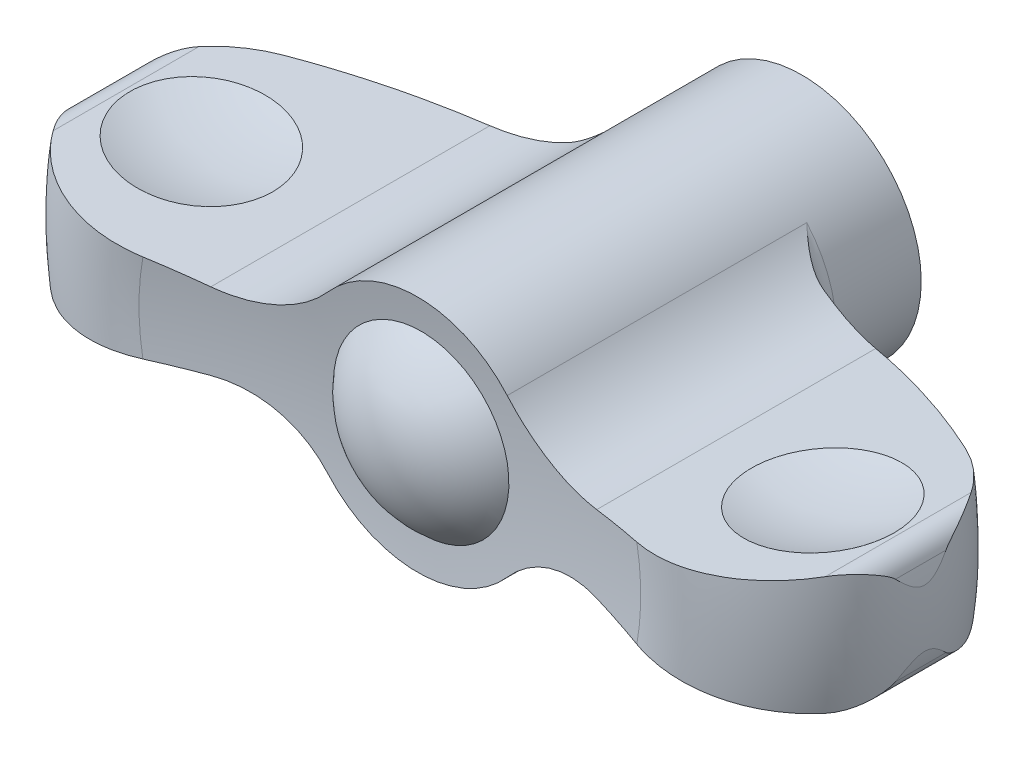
ISO-10303-21;
HEADER;
FILE_DESCRIPTION(('STEP AP214'),'2;1');
FILE_NAME('part.step','',(''),(''),'','','');
FILE_SCHEMA(('AUTOMOTIVE_DESIGN { 1 0 10303 214 1 1 1 1 }'));
ENDSEC;
DATA;
#1=APPLICATION_CONTEXT('core data for automotive mechanical design processes');
#2=APPLICATION_PROTOCOL_DEFINITION('international standard','automotive_design',2000,#1);
#3=PRODUCT_CONTEXT('',#1,'mechanical');
#4=PRODUCT('Part','Part','',(#3));
#5=PRODUCT_RELATED_PRODUCT_CATEGORY('part','',(#4));
#6=PRODUCT_DEFINITION_FORMATION('','',#4);
#7=PRODUCT_DEFINITION_CONTEXT('part definition',#1,'design');
#8=PRODUCT_DEFINITION('design','',#6,#7);
#9=PRODUCT_DEFINITION_SHAPE('','',#8);
#10=(LENGTH_UNIT() NAMED_UNIT(*) SI_UNIT(.MILLI.,.METRE.));
#11=(NAMED_UNIT(*) PLANE_ANGLE_UNIT() SI_UNIT($,.RADIAN.));
#12=(NAMED_UNIT(*) SI_UNIT($,.STERADIAN.) SOLID_ANGLE_UNIT());
#13=UNCERTAINTY_MEASURE_WITH_UNIT(LENGTH_MEASURE(1.E-05),#10,'distance_accuracy_value','');
#14=(GEOMETRIC_REPRESENTATION_CONTEXT(3) GLOBAL_UNCERTAINTY_ASSIGNED_CONTEXT((#13)) GLOBAL_UNIT_ASSIGNED_CONTEXT((#10,
#11,#12)) REPRESENTATION_CONTEXT('',''));
#15=CARTESIAN_POINT('',(0.,0.,0.));
#16=DIRECTION('',(0.,0.,1.));
#17=DIRECTION('',(1.,0.,0.));
#18=AXIS2_PLACEMENT_3D('',#15,#16,#17);
#19=CARTESIAN_POINT('',(0.,0.,72.3));
#20=DIRECTION('',(0.,0.,-1.));
#21=DIRECTION('',(1.,0.,0.));
#22=AXIS2_PLACEMENT_3D('',#19,#20,#21);
#23=SPHERICAL_SURFACE('',#22,51.);
#24=CARTESIAN_POINT('',(0.106101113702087,-0.984705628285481,72.3));
#25=DIRECTION('',(-0.107128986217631,0.994245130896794,0.));
#26=DIRECTION('',(-0.994245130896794,-0.107128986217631,0.));
#27=AXIS2_PLACEMENT_3D('',#24,#25,#26);
#28=CIRCLE('',#27,50.9903824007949);
#29=CARTESIAN_POINT('',(-13.9736878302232,-2.50178976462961,23.3155422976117));
#30=VERTEX_POINT('',#29);
#31=CARTESIAN_POINT('',(-10.91666942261,-2.17239888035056,22.529456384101));
#32=VERTEX_POINT('',#31);
#33=EDGE_CURVE('E32',#30,#32,#28,.F.);
#34=ORIENTED_EDGE('',*,*,#33,.T.);
#35=CARTESIAN_POINT('',(-10.91686942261,-2.17242043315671,22.5295011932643));
#36=CARTESIAN_POINT('',(-10.7296469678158,-2.15222267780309,22.4875506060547));
#37=CARTESIAN_POINT('',(-10.5413017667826,-2.13980901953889,22.4468208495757));
#38=CARTESIAN_POINT('',(-10.1636425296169,-2.13069190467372,22.3680695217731));
#39=CARTESIAN_POINT('',(-9.97432836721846,-2.13399055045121,22.3300483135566));
#40=CARTESIAN_POINT('',(-9.59601268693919,-2.15644826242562,22.2569830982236));
#41=CARTESIAN_POINT('',(-9.40701125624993,-2.17561118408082,22.2219398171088));
#42=CARTESIAN_POINT('',(-9.03072706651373,-2.22980411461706,22.1550981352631));
#43=CARTESIAN_POINT('',(-8.84344419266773,-2.26483305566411,22.1232995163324));
#44=CARTESIAN_POINT('',(-8.47162022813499,-2.35072423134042,22.063129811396));
#45=CARTESIAN_POINT('',(-8.2870846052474,-2.40161451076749,22.034764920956));
#46=CARTESIAN_POINT('',(-7.92248584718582,-2.51896555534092,21.9817487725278));
#47=CARTESIAN_POINT('',(-7.7424225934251,-2.5854259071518,21.9570974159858));
#48=CARTESIAN_POINT('',(-7.38832723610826,-2.7334638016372,21.9117265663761));
#49=CARTESIAN_POINT('',(-7.21428915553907,-2.81502582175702,21.8910030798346));
#50=CARTESIAN_POINT('',(-6.87341920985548,-2.99279306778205,21.8536266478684));
#51=CARTESIAN_POINT('',(-6.70658636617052,-3.08899629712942,21.836973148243));
#52=CARTESIAN_POINT('',(-6.40782206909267,-3.27863643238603,21.8102333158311));
#53=CARTESIAN_POINT('',(-6.27461901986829,-3.36999069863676,21.7995199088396));
#54=CARTESIAN_POINT('',(-6.01493123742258,-3.56204909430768,21.7811068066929));
#55=CARTESIAN_POINT('',(-5.88844563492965,-3.66275200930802,21.7734067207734));
#56=CARTESIAN_POINT('',(-5.64271699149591,-3.87314316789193,21.7610572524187));
#57=CARTESIAN_POINT('',(-5.52348434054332,-3.98284379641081,21.7564121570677));
#58=CARTESIAN_POINT('',(-5.29308424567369,-4.2105332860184,21.7502131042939));
#59=CARTESIAN_POINT('',(-5.18191832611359,-4.32852370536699,21.7486597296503));
#60=CARTESIAN_POINT('',(-5.07512339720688,-4.4503508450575,21.7486647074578));
#61=B_SPLINE_CURVE_WITH_KNOTS('',3,(#35,#36,#37,#38,#39,#40,#41,#42,#43,#44,#45,#46,#47,#48,#49,
#50,#51,#52,#53,#54,#55,#56,#57,#58,#59,#60),.UNSPECIFIED.,.F.,.F.,(4,2,2,2,2,2,2,2,2,2,2,2,4),
(0.,0.578626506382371,1.15733043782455,1.73617505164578,2.31498071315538,2.89481563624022,
3.47463516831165,4.05386199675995,4.63300990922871,5.1182130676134,5.60335328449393,
6.08917285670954,6.57508399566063),.UNSPECIFIED.);
#62=CARTESIAN_POINT('',(-5.07529875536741,-4.4501508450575,21.7486647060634));
#63=VERTEX_POINT('',#62);
#64=EDGE_CURVE('E36',#32,#63,#61,.T.);
#65=ORIENTED_EDGE('',*,*,#64,.T.);
#66=CARTESIAN_POINT('',(0.,0.,21.7486647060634));
#67=DIRECTION('',(0.,0.,1.));
#68=DIRECTION('',(1.,0.,0.));
#69=AXIS2_PLACEMENT_3D('',#66,#67,#68);
#70=CIRCLE('',#69,6.75);
#71=CARTESIAN_POINT('',(5.07529875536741,-4.4501508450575,21.7486647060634));
#72=VERTEX_POINT('',#71);
#73=EDGE_CURVE('E352',#63,#72,#70,.T.);
#74=ORIENTED_EDGE('',*,*,#73,.T.);
#75=CARTESIAN_POINT('',(5.07512339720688,-4.4503508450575,21.7486647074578));
#76=CARTESIAN_POINT('',(5.19811151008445,-4.31003841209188,21.7486568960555));
#77=CARTESIAN_POINT('',(5.32690563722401,-4.1748233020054,21.750718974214));
#78=CARTESIAN_POINT('',(5.59507822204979,-3.91549700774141,21.7589403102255));
#79=CARTESIAN_POINT('',(5.73445549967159,-3.79138458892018,21.7650991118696));
#80=CARTESIAN_POINT('',(6.0224023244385,-3.55546265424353,21.7814490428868));
#81=CARTESIAN_POINT('',(6.17094583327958,-3.44362058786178,21.7916291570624));
#82=CARTESIAN_POINT('',(6.47646460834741,-3.23260452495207,21.8159402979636));
#83=CARTESIAN_POINT('',(6.63343982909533,-3.13343046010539,21.8300713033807));
#84=CARTESIAN_POINT('',(6.9547027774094,-2.94837494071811,21.8621786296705));
#85=CARTESIAN_POINT('',(7.11899194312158,-2.86249611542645,21.8801557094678));
#86=CARTESIAN_POINT('',(7.45373433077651,-2.70454154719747,21.9198257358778));
#87=CARTESIAN_POINT('',(7.62419031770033,-2.63247208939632,21.9415203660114));
#88=CARTESIAN_POINT('',(7.9700647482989,-2.50255377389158,21.9884706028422));
#89=CARTESIAN_POINT('',(8.14548582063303,-2.44471261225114,22.013728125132));
#90=CARTESIAN_POINT('',(8.49988931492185,-2.34360925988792,22.0675996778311));
#91=CARTESIAN_POINT('',(8.67887012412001,-2.30034061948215,22.0962122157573));
#92=CARTESIAN_POINT('',(9.02900148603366,-2.2305564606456,22.1548846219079));
#93=CARTESIAN_POINT('',(9.20002034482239,-2.20322989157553,22.1847703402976));
#94=CARTESIAN_POINT('',(9.54316942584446,-2.1617212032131,22.2471706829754));
#95=CARTESIAN_POINT('',(9.7152996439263,-2.14753903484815,22.2796852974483));
#96=CARTESIAN_POINT('',(10.0596012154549,-2.13229985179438,22.3471369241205));
#97=CARTESIAN_POINT('',(10.2317725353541,-2.13123840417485,22.382073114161));
#98=CARTESIAN_POINT('',(10.5752280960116,-2.14211213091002,22.4541699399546));
#99=CARTESIAN_POINT('',(10.746512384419,-2.154046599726,22.4913304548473));
#100=CARTESIAN_POINT('',(10.91686942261,-2.17242043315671,22.5295011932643));
#101=B_SPLINE_CURVE_WITH_KNOTS('',3,(#75,#76,#77,#78,#79,#80,#81,#82,#83,#84,#85,#86,#87,#88,
#89,#90,#91,#92,#93,#94,#95,#96,#97,#98,#99,#100),.UNSPECIFIED.,.F.,.F.,(4,2,2,2,2,2,2,2,2,2,2,
2,4),(0.,0.559574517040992,1.11908673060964,1.67707683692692,2.2350639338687,2.79316123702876,
3.35151194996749,3.91016401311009,4.46856849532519,4.99529953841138,5.52202861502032,
6.04857972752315,6.57510225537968),.UNSPECIFIED.);
#102=CARTESIAN_POINT('',(10.91666942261,-2.17239888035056,22.529456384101));
#103=VERTEX_POINT('',#102);
#104=EDGE_CURVE('E345',#72,#103,#101,.T.);
#105=ORIENTED_EDGE('',*,*,#104,.T.);
#106=CARTESIAN_POINT('',(-0.10610111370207,-0.984705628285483,72.3));
#107=DIRECTION('',(0.107128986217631,0.994245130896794,0.));
#108=DIRECTION('',(-0.994245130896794,0.107128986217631,0.));
#109=AXIS2_PLACEMENT_3D('',#106,#107,#108);
#110=CIRCLE('',#109,50.9903824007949);
#111=CARTESIAN_POINT('',(13.9736878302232,-2.50178976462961,23.3155422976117));
#112=VERTEX_POINT('',#111);
#113=EDGE_CURVE('E353',#103,#112,#110,.F.);
#114=ORIENTED_EDGE('',*,*,#113,.T.);
#115=CARTESIAN_POINT('',(0.,0.,23.3155422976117));
#116=DIRECTION('',(0.,0.,-1.));
#117=DIRECTION('',(-1.,0.,0.));
#118=AXIS2_PLACEMENT_3D('',#115,#116,#117);
#119=CIRCLE('',#118,14.1958762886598);
#120=CARTESIAN_POINT('',(13.9736878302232,2.50178976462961,23.3155422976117));
#121=VERTEX_POINT('',#120);
#122=EDGE_CURVE('E187',#121,#112,#119,.T.);
#123=ORIENTED_EDGE('',*,*,#122,.F.);
#124=CARTESIAN_POINT('',(-0.10610111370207,0.984705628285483,72.3));
#125=DIRECTION('',(0.107128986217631,-0.994245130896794,0.));
#126=DIRECTION('',(0.994245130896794,0.107128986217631,0.));
#127=AXIS2_PLACEMENT_3D('',#124,#125,#126);
#128=CIRCLE('',#127,50.9903824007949);
#129=CARTESIAN_POINT('',(10.91666942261,2.17239888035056,22.529456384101));
#130=VERTEX_POINT('',#129);
#131=EDGE_CURVE('E24',#121,#130,#128,.F.);
#132=ORIENTED_EDGE('',*,*,#131,.T.);
#133=CARTESIAN_POINT('',(10.91686942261,2.17242043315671,22.5295011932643));
#134=CARTESIAN_POINT('',(10.7296469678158,2.15222267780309,22.4875506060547));
#135=CARTESIAN_POINT('',(10.5413017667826,2.13980901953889,22.4468208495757));
#136=CARTESIAN_POINT('',(10.1636425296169,2.13069190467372,22.3680695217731));
#137=CARTESIAN_POINT('',(9.97432836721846,2.13399055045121,22.3300483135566));
#138=CARTESIAN_POINT('',(9.59601268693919,2.15644826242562,22.2569830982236));
#139=CARTESIAN_POINT('',(9.40701125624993,2.17561118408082,22.2219398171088));
#140=CARTESIAN_POINT('',(9.03072706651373,2.22980411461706,22.1550981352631));
#141=CARTESIAN_POINT('',(8.84344419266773,2.26483305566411,22.1232995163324));
#142=CARTESIAN_POINT('',(8.47162022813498,2.35072423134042,22.063129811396));
#143=CARTESIAN_POINT('',(8.2870846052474,2.40161451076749,22.034764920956));
#144=CARTESIAN_POINT('',(7.92248584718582,2.51896555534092,21.9817487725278));
#145=CARTESIAN_POINT('',(7.7424225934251,2.5854259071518,21.9570974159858));
#146=CARTESIAN_POINT('',(7.38832723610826,2.7334638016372,21.9117265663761));
#147=CARTESIAN_POINT('',(7.21428915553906,2.81502582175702,21.8910030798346));
#148=CARTESIAN_POINT('',(6.87341920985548,2.99279306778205,21.8536266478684));
#149=CARTESIAN_POINT('',(6.70658636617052,3.08899629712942,21.836973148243));
#150=CARTESIAN_POINT('',(6.40782206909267,3.27863643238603,21.8102333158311));
#151=CARTESIAN_POINT('',(6.27461901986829,3.36999069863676,21.7995199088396));
#152=CARTESIAN_POINT('',(6.01493123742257,3.56204909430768,21.7811068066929));
#153=CARTESIAN_POINT('',(5.88844563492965,3.66275200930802,21.7734067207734));
#154=CARTESIAN_POINT('',(5.64271699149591,3.87314316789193,21.7610572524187));
#155=CARTESIAN_POINT('',(5.52348434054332,3.98284379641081,21.7564121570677));
#156=CARTESIAN_POINT('',(5.29308424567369,4.2105332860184,21.7502131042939));
#157=CARTESIAN_POINT('',(5.18191832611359,4.32852370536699,21.7486597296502));
#158=CARTESIAN_POINT('',(5.07512339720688,4.4503508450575,21.7486647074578));
#159=B_SPLINE_CURVE_WITH_KNOTS('',3,(#133,#134,#135,#136,#137,#138,#139,#140,#141,#142,#143,
#144,#145,#146,#147,#148,#149,#150,#151,#152,#153,#154,#155,#156,#157,#158),.UNSPECIFIED.,.F.,
.F.,(4,2,2,2,2,2,2,2,2,2,2,2,4),(0.,0.578626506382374,1.15733043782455,1.73617505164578,
2.31498071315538,2.89481563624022,3.47463516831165,4.05386199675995,4.63300990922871,
5.1182130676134,5.60335328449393,6.08917285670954,6.57508399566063),.UNSPECIFIED.);
#160=CARTESIAN_POINT('',(5.07529875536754,4.45015084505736,21.7486647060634));
#161=VERTEX_POINT('',#160);
#162=EDGE_CURVE('E321',#130,#161,#159,.T.);
#163=ORIENTED_EDGE('',*,*,#162,.T.);
#164=CARTESIAN_POINT('',(0.,0.,21.7486647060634));
#165=DIRECTION('',(0.,0.,1.));
#166=DIRECTION('',(1.,0.,0.));
#167=AXIS2_PLACEMENT_3D('',#164,#165,#166);
#168=CIRCLE('',#167,6.75);
#169=CARTESIAN_POINT('',(-5.07529875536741,4.4501508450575,21.7486647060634));
#170=VERTEX_POINT('',#169);
#171=EDGE_CURVE('E327',#161,#170,#168,.T.);
#172=ORIENTED_EDGE('',*,*,#171,.T.);
#173=CARTESIAN_POINT('',(-5.07512339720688,4.4503508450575,21.7486647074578));
#174=CARTESIAN_POINT('',(-5.19811151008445,4.31003841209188,21.7486568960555));
#175=CARTESIAN_POINT('',(-5.32690563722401,4.1748233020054,21.750718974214));
#176=CARTESIAN_POINT('',(-5.59507822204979,3.91549700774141,21.7589403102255));
#177=CARTESIAN_POINT('',(-5.73445549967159,3.79138458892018,21.7650991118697));
#178=CARTESIAN_POINT('',(-6.0224023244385,3.55546265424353,21.7814490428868));
#179=CARTESIAN_POINT('',(-6.17094583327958,3.44362058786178,21.7916291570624));
#180=CARTESIAN_POINT('',(-6.47646460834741,3.23260452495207,21.8159402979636));
#181=CARTESIAN_POINT('',(-6.63343982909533,3.13343046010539,21.8300713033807));
#182=CARTESIAN_POINT('',(-6.9547027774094,2.94837494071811,21.8621786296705));
#183=CARTESIAN_POINT('',(-7.11899194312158,2.86249611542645,21.8801557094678));
#184=CARTESIAN_POINT('',(-7.45373433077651,2.70454154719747,21.9198257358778));
#185=CARTESIAN_POINT('',(-7.62419031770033,2.63247208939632,21.9415203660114));
#186=CARTESIAN_POINT('',(-7.9700647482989,2.50255377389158,21.9884706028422));
#187=CARTESIAN_POINT('',(-8.14548582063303,2.44471261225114,22.013728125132));
#188=CARTESIAN_POINT('',(-8.49988931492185,2.34360925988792,22.0675996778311));
#189=CARTESIAN_POINT('',(-8.67887012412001,2.30034061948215,22.0962122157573));
#190=CARTESIAN_POINT('',(-9.02900148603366,2.2305564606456,22.1548846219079));
#191=CARTESIAN_POINT('',(-9.20002034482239,2.20322989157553,22.1847703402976));
#192=CARTESIAN_POINT('',(-9.54316942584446,2.1617212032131,22.2471706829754));
#193=CARTESIAN_POINT('',(-9.7152996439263,2.14753903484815,22.2796852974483));
#194=CARTESIAN_POINT('',(-10.0596012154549,2.13229985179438,22.3471369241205));
#195=CARTESIAN_POINT('',(-10.2317725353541,2.13123840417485,22.382073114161));
#196=CARTESIAN_POINT('',(-10.5752280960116,2.14211213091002,22.4541699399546));
#197=CARTESIAN_POINT('',(-10.746512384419,2.154046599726,22.4913304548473));
#198=CARTESIAN_POINT('',(-10.91686942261,2.17242043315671,22.5295011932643));
#199=B_SPLINE_CURVE_WITH_KNOTS('',3,(#173,#174,#175,#176,#177,#178,#179,#180,#181,#182,#183,
#184,#185,#186,#187,#188,#189,#190,#191,#192,#193,#194,#195,#196,#197,#198),.UNSPECIFIED.,.F.,
.F.,(4,2,2,2,2,2,2,2,2,2,2,2,4),(0.,0.559574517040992,1.11908673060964,1.67707683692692,
2.2350639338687,2.79316123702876,3.35151194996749,3.91016401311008,4.46856849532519,
4.99529953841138,5.52202861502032,6.04857972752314,6.57510225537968),.UNSPECIFIED.);
#200=CARTESIAN_POINT('',(-10.91666942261,2.17239888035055,22.529456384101));
#201=VERTEX_POINT('',#200);
#202=EDGE_CURVE('E192',#170,#201,#199,.T.);
#203=ORIENTED_EDGE('',*,*,#202,.T.);
#204=CARTESIAN_POINT('',(0.106101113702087,0.984705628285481,72.3));
#205=DIRECTION('',(-0.107128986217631,-0.994245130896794,0.));
#206=DIRECTION('',(0.994245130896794,-0.107128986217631,0.));
#207=AXIS2_PLACEMENT_3D('',#204,#205,#206);
#208=CIRCLE('',#207,50.9903824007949);
#209=CARTESIAN_POINT('',(-13.9736878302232,2.50178976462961,23.3155422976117));
#210=VERTEX_POINT('',#209);
#211=EDGE_CURVE('E692',#201,#210,#208,.F.);
#212=ORIENTED_EDGE('',*,*,#211,.T.);
#213=EDGE_CURVE('E399',#30,#210,#119,.T.);
#214=ORIENTED_EDGE('',*,*,#213,.F.);
#215=EDGE_LOOP('',(#34,#65,#74,#105,#114,#123,#132,#163,#172,#203,#212,#214));
#216=FACE_BOUND('',#215,.T.);
#217=CARTESIAN_POINT('',(0.,0.,21.5419708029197));
#218=DIRECTION('',(0.,0.,-1.));
#219=DIRECTION('',(-1.,0.,0.));
#220=AXIS2_PLACEMENT_3D('',#217,#218,#219);
#221=CIRCLE('',#220,4.96210358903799);
#222=CARTESIAN_POINT('',(-4.96210358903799,0.,21.5419708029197));
#223=VERTEX_POINT('',#222);
#224=EDGE_CURVE('E384',#223,#223,#221,.T.);
#225=ORIENTED_EDGE('',*,*,#224,.T.);
#226=EDGE_LOOP('',(#225));
#227=FACE_BOUND('',#226,.T.);
#228=ADVANCED_FACE('F14',(#216,#227),#23,.F.);
#229=CARTESIAN_POINT('',(0.,0.,12.));
#230=DIRECTION('',(0.,0.,-1.));
#231=DIRECTION('',(-1.,0.,0.));
#232=AXIS2_PLACEMENT_3D('',#229,#230,#231);
#233=CYLINDRICAL_SURFACE('',#232,2.5);
#234=CARTESIAN_POINT('',(0.,0.,0.));
#235=DIRECTION('',(0.,0.,1.));
#236=DIRECTION('',(1.,0.,0.));
#237=AXIS2_PLACEMENT_3D('',#234,#235,#236);
#238=CIRCLE('',#237,2.5);
#239=CARTESIAN_POINT('',(2.5,0.,0.));
#240=VERTEX_POINT('',#239);
#241=EDGE_CURVE('E380',#240,#240,#238,.T.);
#242=ORIENTED_EDGE('',*,*,#241,.F.);
#243=EDGE_LOOP('',(#242));
#244=FACE_BOUND('',#243,.T.);
#245=CARTESIAN_POINT('',(0.,0.,12.));
#246=DIRECTION('',(0.,0.,-1.));
#247=DIRECTION('',(-1.,0.,0.));
#248=AXIS2_PLACEMENT_3D('',#245,#246,#247);
#249=CIRCLE('',#248,2.5);
#250=CARTESIAN_POINT('',(-2.5,0.,12.));
#251=VERTEX_POINT('',#250);
#252=EDGE_CURVE('E389',#251,#251,#249,.T.);
#253=ORIENTED_EDGE('',*,*,#252,.F.);
#254=EDGE_LOOP('',(#253));
#255=FACE_BOUND('',#254,.T.);
#256=ADVANCED_FACE('F332',(#244,#255),#233,.F.);
#257=CARTESIAN_POINT('',(10.1881923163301,8.93326577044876,0.));
#258=DIRECTION('',(0.,0.,1.));
#259=DIRECTION('',(1.,0.,0.));
#260=AXIS2_PLACEMENT_3D('',#257,#258,#259);
#261=PLANE('',#260);
#262=CARTESIAN_POINT('',(0.,0.,0.));
#263=DIRECTION('',(0.,0.,1.));
#264=DIRECTION('',(1.,0.,0.));
#265=AXIS2_PLACEMENT_3D('',#262,#263,#264);
#266=CIRCLE('',#265,6.75);
#267=CARTESIAN_POINT('',(6.75,0.,0.));
#268=VERTEX_POINT('',#267);
#269=EDGE_CURVE('E498',#268,#268,#266,.T.);
#270=ORIENTED_EDGE('',*,*,#269,.F.);
#271=EDGE_LOOP('',(#270));
#272=FACE_BOUND('',#271,.T.);
#273=ORIENTED_EDGE('',*,*,#241,.T.);
#274=EDGE_LOOP('',(#273));
#275=FACE_BOUND('',#274,.T.);
#276=ADVANCED_FACE('F776',(#272,#275),#261,.F.);
#277=CARTESIAN_POINT('',(-10.91666942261,-2.17239888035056,24.));
#278=DIRECTION('',(-0.107128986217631,0.994245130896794,0.));
#279=DIRECTION('',(-0.994245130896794,-0.107128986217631,0.));
#280=AXIS2_PLACEMENT_3D('',#277,#278,#279);
#281=PLANE('',#280);
#282=ORIENTED_EDGE('',*,*,#33,.F.);
#283=CARTESIAN_POINT('',(-21.8457309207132,-3.34999507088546,20.5252646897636));
#284=CARTESIAN_POINT('',(-21.7302435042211,-3.33755140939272,20.6912978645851));
#285=CARTESIAN_POINT('',(-21.6077536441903,-3.32435324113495,20.8523984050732));
#286=CARTESIAN_POINT('',(-21.3497248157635,-3.29655087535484,21.1636425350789));
#287=CARTESIAN_POINT('',(-21.2141865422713,-3.28194675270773,21.3137867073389));
#288=CARTESIAN_POINT('',(-20.9311105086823,-3.25144557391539,21.6019360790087));
#289=CARTESIAN_POINT('',(-20.783581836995,-3.23554949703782,21.7399503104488));
#290=CARTESIAN_POINT('',(-20.4774952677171,-3.20256895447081,22.0029918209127));
#291=CARTESIAN_POINT('',(-20.3189374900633,-3.18548450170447,22.1280192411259));
#292=CARTESIAN_POINT('',(-19.9918782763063,-3.15024417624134,22.3642331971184));
#293=CARTESIAN_POINT('',(-19.8233743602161,-3.13208803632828,22.4754162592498));
#294=CARTESIAN_POINT('',(-19.4775952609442,-3.09483066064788,22.6831586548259));
#295=CARTESIAN_POINT('',(-19.3003168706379,-3.07572907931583,22.7797125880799));
#296=CARTESIAN_POINT('',(-18.9383738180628,-3.0367300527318,22.9574348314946));
#297=CARTESIAN_POINT('',(-18.7537118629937,-3.01683289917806,23.0386087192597));
#298=CARTESIAN_POINT('',(-18.3782492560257,-2.97637715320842,23.1850463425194));
#299=CARTESIAN_POINT('',(-18.1874484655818,-2.95581854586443,23.2503097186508));
#300=CARTESIAN_POINT('',(-17.8008818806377,-2.91416635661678,23.3645224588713));
#301=CARTESIAN_POINT('',(-17.6051115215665,-2.89307228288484,23.4134561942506));
#302=CARTESIAN_POINT('',(-17.2101714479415,-2.85051785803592,23.4945837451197));
#303=CARTESIAN_POINT('',(-17.011001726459,-2.82905750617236,23.5267775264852));
#304=CARTESIAN_POINT('',(-16.6106619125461,-2.78592126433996,23.5742057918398));
#305=CARTESIAN_POINT('',(-16.4094916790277,-2.76424535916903,23.589439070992));
#306=CARTESIAN_POINT('',(-16.006594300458,-2.72083354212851,23.6028415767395));
#307=CARTESIAN_POINT('',(-15.804867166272,-2.69909763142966,23.6010111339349));
#308=CARTESIAN_POINT('',(-15.4019677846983,-2.65568559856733,23.5802910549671));
#309=CARTESIAN_POINT('',(-15.2007968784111,-2.63400962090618,23.5613750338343));
#310=CARTESIAN_POINT('',(-14.8008192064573,-2.59091239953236,23.5065973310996));
#311=CARTESIAN_POINT('',(-14.6020116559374,-2.56949107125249,23.47074144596));
#312=CARTESIAN_POINT('',(-14.2079744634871,-2.52703393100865,23.3823184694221));
#313=CARTESIAN_POINT('',(-14.0127471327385,-2.50599836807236,23.3297409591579));
#314=CARTESIAN_POINT('',(-13.6273876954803,-2.46447624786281,23.208260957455));
#315=CARTESIAN_POINT('',(-13.4372553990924,-2.44398967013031,23.1393590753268));
#316=CARTESIAN_POINT('',(-13.0629639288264,-2.40366011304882,22.985531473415));
#317=CARTESIAN_POINT('',(-12.8788206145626,-2.38381884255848,22.9005667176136));
#318=CARTESIAN_POINT('',(-12.5183119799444,-2.34497437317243,22.7153302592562));
#319=CARTESIAN_POINT('',(-12.3419464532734,-2.3259711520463,22.6150589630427));
#320=CARTESIAN_POINT('',(-11.9985630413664,-2.28897190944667,22.400122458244));
#321=CARTESIAN_POINT('',(-11.8315288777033,-2.27097413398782,22.2854835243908));
#322=CARTESIAN_POINT('',(-11.5077189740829,-2.23608391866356,22.0425218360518));
#323=CARTESIAN_POINT('',(-11.3509370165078,-2.21919080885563,21.9142075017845));
#324=CARTESIAN_POINT('',(-11.1514082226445,-2.19769176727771,21.7363546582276));
#325=CARTESIAN_POINT('',(-11.1035524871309,-2.19253535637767,21.6925222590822));
#326=CARTESIAN_POINT('',(-11.0090859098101,-2.18235667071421,21.6036210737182));
#327=CARTESIAN_POINT('',(-10.9624737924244,-2.17733425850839,21.5585536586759));
#328=CARTESIAN_POINT('',(-10.91646942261,-2.17237733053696,21.5128574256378));
#329=B_SPLINE_CURVE_WITH_KNOTS('',3,(#283,#284,#285,#286,#287,#288,#289,#290,#291,#292,#293,
#294,#295,#296,#297,#298,#299,#300,#301,#302,#303,#304,#305,#306,#307,#308,#309,#310,#311,#312,
#313,#314,#315,#316,#317,#318,#319,#320,#321,#322,#323,#324,#325,#326,#327,#328),.UNSPECIFIED.,
.F.,.F.,(4,2,2,2,2,2,2,2,2,2,2,2,2,2,2,2,2,2,2,2,2,2,4),(0.,0.607705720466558,1.21537909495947,
1.82259608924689,2.42980648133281,3.03716892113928,3.64475501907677,4.25212035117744,
4.85949940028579,5.46745810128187,6.07541804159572,6.68342116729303,7.29141251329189,
7.90034437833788,8.50906803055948,9.11817171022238,9.72725265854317,10.3378332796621,
10.9483976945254,11.557861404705,12.166952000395,12.3622359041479,12.5573111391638),.UNSPECIFIED.);
#330=CARTESIAN_POINT('',(-21.8455309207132,-3.34997352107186,20.5255521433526));
#331=VERTEX_POINT('',#330);
#332=EDGE_CURVE('E520',#331,#30,#329,.T.);
#333=ORIENTED_EDGE('',*,*,#332,.F.);
#334=DIRECTION('',(0.,0.,-1.));
#335=VECTOR('',#334,1.);
#336=CARTESIAN_POINT('',(-21.8455309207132,-3.34997352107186,24.));
#337=LINE('',#336,#335);
#338=CARTESIAN_POINT('',(-21.8455309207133,-3.34997352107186,12.2746267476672));
#339=VERTEX_POINT('',#338);
#340=EDGE_CURVE('E442',#331,#339,#337,.T.);
#341=ORIENTED_EDGE('',*,*,#340,.T.);
#342=CARTESIAN_POINT('',(-19.2945778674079,-3.07511070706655,10.0206583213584));
#343=CARTESIAN_POINT('',(-19.4747975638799,-3.09452921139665,10.1153575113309));
#344=CARTESIAN_POINT('',(-19.6509896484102,-3.11351374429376,10.2178086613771));
#345=CARTESIAN_POINT('',(-19.9941575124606,-3.15048976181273,10.4374340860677));
#346=CARTESIAN_POINT('',(-20.1611295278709,-3.16848084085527,10.55461431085));
#347=CARTESIAN_POINT('',(-20.4813600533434,-3.20298538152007,10.8003921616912));
#348=CARTESIAN_POINT('',(-20.6348240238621,-3.21952098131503,10.9287191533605));
#349=CARTESIAN_POINT('',(-20.9305024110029,-3.25138005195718,11.1977390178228));
#350=CARTESIAN_POINT('',(-21.0727226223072,-3.26670414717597,11.3384254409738));
#351=CARTESIAN_POINT('',(-21.3235946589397,-3.29373537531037,11.608219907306));
#352=CARTESIAN_POINT('',(-21.43401009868,-3.3056325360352,11.7356749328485));
#353=CARTESIAN_POINT('',(-21.6465578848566,-3.32853436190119,11.9991858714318));
#354=CARTESIAN_POINT('',(-21.7486121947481,-3.33953061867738,12.135305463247));
#355=CARTESIAN_POINT('',(-21.8457309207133,-3.34999507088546,12.2749142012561));
#356=B_SPLINE_CURVE_WITH_KNOTS('',3,(#342,#343,#344,#345,#346,#347,#348,#349,#350,#351,#352,
#353,#354,#355),.UNSPECIFIED.,.F.,.F.,(4,2,2,2,2,2,4),(0.,0.613344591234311,1.22693775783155,
1.82843414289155,2.42961848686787,2.93636077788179,3.44739305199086),.UNSPECIFIED.);
#357=CARTESIAN_POINT('',(-19.2949583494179,-3.07515170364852,10.0208583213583));
#358=VERTEX_POINT('',#357);
#359=EDGE_CURVE('E468',#358,#339,#356,.T.);
#360=ORIENTED_EDGE('',*,*,#359,.F.);
#361=CARTESIAN_POINT('',(-10.91646942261,-2.17237733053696,6.74022888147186));
#362=CARTESIAN_POINT('',(-11.6429801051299,-2.2506581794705,6.93529272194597));
#363=CARTESIAN_POINT('',(-12.3641189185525,-2.32836021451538,7.15058575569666));
#364=CARTESIAN_POINT('',(-13.791310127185,-2.48213873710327,7.62017172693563));
#365=CARTESIAN_POINT('',(-14.4974016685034,-2.558219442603,7.87434431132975));
#366=CARTESIAN_POINT('',(-15.8945921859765,-2.70876541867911,8.42142446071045));
#367=CARTESIAN_POINT('',(-16.5856911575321,-2.78323068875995,8.71433203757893));
#368=CARTESIAN_POINT('',(-17.9528888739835,-2.93054496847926,9.33891493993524));
#369=CARTESIAN_POINT('',(-18.6289355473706,-3.0033883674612,9.67070557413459));
#370=CARTESIAN_POINT('',(-19.2953387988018,-3.07519269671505,10.0210583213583));
#371=B_SPLINE_CURVE_WITH_KNOTS('',3,(#361,#362,#363,#364,#365,#366,#367,#368,#369,#370),
.UNSPECIFIED.,.F.,.F.,(4,2,2,2,4),(0.,2.26861905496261,4.53035255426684,6.79208674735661,
9.06070650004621),.UNSPECIFIED.);
#372=CARTESIAN_POINT('',(-10.91666942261,-2.17239888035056,6.74028258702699));
#373=VERTEX_POINT('',#372);
#374=EDGE_CURVE('E269',#373,#358,#371,.T.);
#375=ORIENTED_EDGE('',*,*,#374,.F.);
#376=DIRECTION('',(0.,0.,-1.));
#377=VECTOR('',#376,1.);
#378=CARTESIAN_POINT('',(-10.91666942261,-2.17239888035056,24.));
#379=LINE('',#378,#377);
#380=EDGE_CURVE('E434',#32,#373,#379,.T.);
#381=ORIENTED_EDGE('',*,*,#380,.F.);
#382=EDGE_LOOP('',(#282,#333,#341,#360,#375,#381));
#383=FACE_BOUND('',#382,.T.);
#384=CARTESIAN_POINT('',(-17.5815922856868,-2.89053810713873,16.4));
#385=DIRECTION('',(-0.107128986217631,0.994245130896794,0.));
#386=DIRECTION('',(-0.994245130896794,-0.107128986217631,0.));
#387=AXIS2_PLACEMENT_3D('',#384,#385,#386);
#388=CIRCLE('',#387,4.06502356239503);
#389=CARTESIAN_POINT('',(-21.6232221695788,-3.3260199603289,16.4));
#390=VERTEX_POINT('',#389);
#391=EDGE_CURVE('E19',#390,#390,#388,.F.);
#392=ORIENTED_EDGE('',*,*,#391,.F.);
#393=EDGE_LOOP('',(#392));
#394=FACE_BOUND('',#393,.T.);
#395=ADVANCED_FACE('F293',(#383,#394),#281,.F.);
#396=CARTESIAN_POINT('',(-10.91666942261,2.17239888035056,24.));
#397=DIRECTION('',(-0.107128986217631,-0.994245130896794,0.));
#398=DIRECTION('',(0.994245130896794,-0.107128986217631,0.));
#399=AXIS2_PLACEMENT_3D('',#396,#397,#398);
#400=PLANE('',#399);
#401=ORIENTED_EDGE('',*,*,#211,.F.);
#402=DIRECTION('',(0.,0.,-1.));
#403=VECTOR('',#402,1.);
#404=CARTESIAN_POINT('',(-10.91666942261,2.17239888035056,24.));
#405=LINE('',#404,#403);
#406=CARTESIAN_POINT('',(-10.91666942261,2.17239888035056,6.74028258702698));
#407=VERTEX_POINT('',#406);
#408=EDGE_CURVE('E194',#201,#407,#405,.T.);
#409=ORIENTED_EDGE('',*,*,#408,.T.);
#410=CARTESIAN_POINT('',(-19.2953387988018,3.07519269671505,10.0210583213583));
#411=CARTESIAN_POINT('',(-18.6289355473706,3.0033883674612,9.67070557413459));
#412=CARTESIAN_POINT('',(-17.9528888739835,2.93054496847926,9.33891493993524));
#413=CARTESIAN_POINT('',(-16.5856911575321,2.78323068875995,8.71433203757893));
#414=CARTESIAN_POINT('',(-15.8945921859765,2.70876541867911,8.42142446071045));
#415=CARTESIAN_POINT('',(-14.4974016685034,2.558219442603,7.87434431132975));
#416=CARTESIAN_POINT('',(-13.791310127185,2.48213873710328,7.62017172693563));
#417=CARTESIAN_POINT('',(-12.3641189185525,2.32836021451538,7.15058575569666));
#418=CARTESIAN_POINT('',(-11.6429801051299,2.2506581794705,6.93529272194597));
#419=CARTESIAN_POINT('',(-10.91646942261,2.17237733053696,6.74022888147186));
#420=B_SPLINE_CURVE_WITH_KNOTS('',3,(#410,#411,#412,#413,#414,#415,#416,#417,#418,#419),
.UNSPECIFIED.,.F.,.F.,(4,2,2,2,4),(0.,2.2686197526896,4.53035394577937,6.7920874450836,
9.06070650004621),.UNSPECIFIED.);
#421=CARTESIAN_POINT('',(-19.2949583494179,3.07515170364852,10.0208583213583));
#422=VERTEX_POINT('',#421);
#423=EDGE_CURVE('E276',#422,#407,#420,.T.);
#424=ORIENTED_EDGE('',*,*,#423,.F.);
#425=CARTESIAN_POINT('',(-16.1316021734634,2.73430302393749,9.20190527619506));
#426=CARTESIAN_POINT('',(-16.3336188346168,2.75607013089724,9.20643915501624));
#427=CARTESIAN_POINT('',(-16.5354410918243,2.777816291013,9.2195877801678));
#428=CARTESIAN_POINT('',(-16.9372607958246,2.82111198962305,9.2629315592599));
#429=CARTESIAN_POINT('',(-17.1372583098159,2.84266153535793,9.29312608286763));
#430=CARTESIAN_POINT('',(-17.53371131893,2.88537897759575,9.37032135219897));
#431=CARTESIAN_POINT('',(-17.7301716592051,2.90654739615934,9.41729692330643));
#432=CARTESIAN_POINT('',(-18.1184556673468,2.94838463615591,9.52772695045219));
#433=CARTESIAN_POINT('',(-18.310279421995,2.9690534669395,9.59118109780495));
#434=CARTESIAN_POINT('',(-18.6875910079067,3.00970843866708,9.73399849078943));
#435=CARTESIAN_POINT('',(-18.8730894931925,3.02969572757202,9.81333326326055));
#436=CARTESIAN_POINT('',(-19.236871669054,3.0688929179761,9.98746420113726));
#437=CARTESIAN_POINT('',(-19.4151520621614,3.08810246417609,10.0822673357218));
#438=CARTESIAN_POINT('',(-19.7631321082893,3.12559698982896,10.2866372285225));
#439=CARTESIAN_POINT('',(-19.9328321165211,3.14388200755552,10.3962033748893));
#440=CARTESIAN_POINT('',(-20.2623750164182,3.17938994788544,10.6292750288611));
#441=CARTESIAN_POINT('',(-20.4222223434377,3.19661334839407,10.7527741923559));
#442=CARTESIAN_POINT('',(-20.7309200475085,3.22987523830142,11.0128081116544));
#443=CARTESIAN_POINT('',(-20.8797763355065,3.24591436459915,11.1493357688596));
#444=CARTESIAN_POINT('',(-21.1655301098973,3.27670406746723,11.4345171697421));
#445=CARTESIAN_POINT('',(-21.3024274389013,3.29145462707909,11.58317107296));
#446=CARTESIAN_POINT('',(-21.5634920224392,3.3195840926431,11.8918051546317));
#447=CARTESIAN_POINT('',(-21.6876381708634,3.33296072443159,12.0518033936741));
#448=CARTESIAN_POINT('',(-21.9220837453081,3.35822201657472,12.3817648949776));
#449=CARTESIAN_POINT('',(-22.0323824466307,3.37010659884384,12.5517286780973));
#450=CARTESIAN_POINT('',(-22.1353199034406,3.3811980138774,12.7260937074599));
#451=B_SPLINE_CURVE_WITH_KNOTS('',3,(#425,#426,#427,#428,#429,#430,#431,#432,#433,#434,#435,
#436,#437,#438,#439,#440,#441,#442,#443,#444,#445,#446,#447,#448,#449,#450),.UNSPECIFIED.,.F.,
.F.,(4,2,2,2,2,2,2,2,2,2,2,2,4),(0.,0.60952472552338,1.21902691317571,1.82761855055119,
2.43619878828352,3.04369749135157,3.65147065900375,4.25921864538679,4.86669101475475,
5.47383427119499,6.080985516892,6.68912606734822,7.29729843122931),.UNSPECIFIED.);
#452=CARTESIAN_POINT('',(-21.845530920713,3.34997352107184,12.2746267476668));
#453=VERTEX_POINT('',#452);
#454=EDGE_CURVE('E303',#453,#422,#451,.F.);
#455=ORIENTED_EDGE('',*,*,#454,.F.);
#456=DIRECTION('',(0.,0.,-1.));
#457=VECTOR('',#456,1.);
#458=CARTESIAN_POINT('',(-21.8455309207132,3.34997352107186,24.));
#459=LINE('',#458,#457);
#460=CARTESIAN_POINT('',(-21.8455309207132,3.34997352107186,20.5255521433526));
#461=VERTEX_POINT('',#460);
#462=EDGE_CURVE('E199',#461,#453,#459,.T.);
#463=ORIENTED_EDGE('',*,*,#462,.F.);
#464=CARTESIAN_POINT('',(-10.91646942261,2.17237733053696,21.5128574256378));
#465=CARTESIAN_POINT('',(-11.060414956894,2.18788732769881,21.6558705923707));
#466=CARTESIAN_POINT('',(-11.2103909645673,2.20404710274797,21.7927365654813));
#467=CARTESIAN_POINT('',(-11.5212615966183,2.23754312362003,22.0532734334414));
#468=CARTESIAN_POINT('',(-11.682155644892,2.25487930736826,22.1769450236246));
#469=CARTESIAN_POINT('',(-12.013622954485,2.29059460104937,22.4101285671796));
#470=CARTESIAN_POINT('',(-12.1841895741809,2.3089729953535,22.5196500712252));
#471=CARTESIAN_POINT('',(-12.5338820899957,2.3466520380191,22.723861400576));
#472=CARTESIAN_POINT('',(-12.7130078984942,2.36595267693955,22.8185513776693));
#473=CARTESIAN_POINT('',(-13.0785959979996,2.40534445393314,22.9924500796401));
#474=CARTESIAN_POINT('',(-13.2650601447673,2.42543579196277,23.0716548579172));
#475=CARTESIAN_POINT('',(-13.6440277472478,2.46626919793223,23.2140153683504));
#476=CARTESIAN_POINT('',(-13.8365334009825,2.48701150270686,23.2771651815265));
#477=CARTESIAN_POINT('',(-14.2260776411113,2.5289845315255,23.3869042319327));
#478=CARTESIAN_POINT('',(-14.4231144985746,2.55021506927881,23.433499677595));
#479=CARTESIAN_POINT('',(-14.8203952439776,2.59302169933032,23.5098273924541));
#480=CARTESIAN_POINT('',(-15.0206391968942,2.6145977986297,23.5395593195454));
#481=CARTESIAN_POINT('',(-15.4229162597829,2.65794277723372,23.581941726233));
#482=CARTESIAN_POINT('',(-15.6249494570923,2.67971166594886,23.5945913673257));
#483=CARTESIAN_POINT('',(-16.0293573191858,2.72328623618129,23.6027094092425));
#484=CARTESIAN_POINT('',(-16.2317319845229,2.74509191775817,23.5981777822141));
#485=CARTESIAN_POINT('',(-16.6353922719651,2.78858593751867,23.5719573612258));
#486=CARTESIAN_POINT('',(-16.8366778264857,2.81027426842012,23.5502675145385));
#487=CARTESIAN_POINT('',(-17.2367059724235,2.85337692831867,23.4898773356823));
#488=CARTESIAN_POINT('',(-17.4354486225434,2.87479126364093,23.451177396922));
#489=CARTESIAN_POINT('',(-17.8286809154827,2.91716167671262,23.3571066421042));
#490=CARTESIAN_POINT('',(-18.0231764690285,2.93811839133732,23.3017608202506));
#491=CARTESIAN_POINT('',(-18.4067663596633,2.97944984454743,23.1747874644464));
#492=CARTESIAN_POINT('',(-18.5958625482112,2.99982478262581,23.1031655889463));
#493=CARTESIAN_POINT('',(-18.9674894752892,3.03986723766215,22.9440840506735));
#494=CARTESIAN_POINT('',(-19.1500160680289,3.05953430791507,22.8566145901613));
#495=CARTESIAN_POINT('',(-19.5070671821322,3.09800623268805,22.6664899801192));
#496=CARTESIAN_POINT('',(-19.6815920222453,3.11681112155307,22.5638354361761));
#497=CARTESIAN_POINT('',(-20.0212685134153,3.15341094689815,22.3441502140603));
#498=CARTESIAN_POINT('',(-20.1864271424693,3.17120663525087,22.2271304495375));
#499=CARTESIAN_POINT('',(-20.5063289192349,3.20567575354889,21.9794851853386));
#500=CARTESIAN_POINT('',(-20.6610723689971,3.22234921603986,21.8488600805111));
#501=CARTESIAN_POINT('',(-20.9587578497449,3.25442454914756,21.5751939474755));
#502=CARTESIAN_POINT('',(-21.1017211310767,3.26982870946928,21.4321762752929));
#503=CARTESIAN_POINT('',(-21.3750859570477,3.29928351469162,21.1345878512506));
#504=CARTESIAN_POINT('',(-21.5054952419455,3.31333499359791,20.9800243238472));
#505=CARTESIAN_POINT('',(-21.6665115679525,3.33068435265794,20.7720063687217));
#506=CARTESIAN_POINT('',(-21.7032508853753,3.3346429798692,20.7232730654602));
#507=CARTESIAN_POINT('',(-21.7754460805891,3.34242194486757,20.6249310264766));
#508=CARTESIAN_POINT('',(-21.8109032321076,3.34624241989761,20.5753232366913));
#509=CARTESIAN_POINT('',(-21.8457309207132,3.34999507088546,20.5252646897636));
#510=B_SPLINE_CURVE_WITH_KNOTS('',3,(#464,#465,#466,#467,#468,#469,#470,#471,#472,#473,#474,
#475,#476,#477,#478,#479,#480,#481,#482,#483,#484,#485,#486,#487,#488,#489,#490,#491,#492,#493,
#494,#495,#496,#497,#498,#499,#500,#501,#502,#503,#504,#505,#506,#507,#508,#509),.UNSPECIFIED.,
.F.,.F.,(4,2,2,2,2,2,2,2,2,2,2,2,2,2,2,2,2,2,2,2,2,2,4),(0.,0.610322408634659,1.22061263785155,
1.83048877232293,2.44035866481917,3.05038378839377,3.66063348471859,4.27065407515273,
4.88068704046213,5.49074994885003,6.10081384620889,6.71091517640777,7.32100239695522,
7.93017809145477,8.5391423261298,9.14848434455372,9.75780206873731,10.3666597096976,
10.9754996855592,11.5832161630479,12.1905555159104,12.3740180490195,12.5572930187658),.UNSPECIFIED.);
#511=EDGE_CURVE('E309',#210,#461,#510,.T.);
#512=ORIENTED_EDGE('',*,*,#511,.F.);
#513=EDGE_LOOP('',(#401,#409,#424,#455,#463,#512));
#514=FACE_BOUND('',#513,.T.);
#515=CARTESIAN_POINT('',(-17.5815922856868,2.89053810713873,16.4));
#516=DIRECTION('',(-0.107128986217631,-0.994245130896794,0.));
#517=DIRECTION('',(0.994245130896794,-0.107128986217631,0.));
#518=AXIS2_PLACEMENT_3D('',#515,#516,#517);
#519=CIRCLE('',#518,4.06502356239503);
#520=CARTESIAN_POINT('',(-13.5399624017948,2.45505625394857,16.4));
#521=VERTEX_POINT('',#520);
#522=EDGE_CURVE('E375',#521,#521,#519,.F.);
#523=ORIENTED_EDGE('',*,*,#522,.F.);
#524=EDGE_LOOP('',(#523));
#525=FACE_BOUND('',#524,.T.);
#526=ADVANCED_FACE('F288',(#514,#525),#400,.F.);
#527=CARTESIAN_POINT('',(10.91666942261,-2.17239888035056,24.));
#528=DIRECTION('',(0.107128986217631,0.994245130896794,0.));
#529=DIRECTION('',(-0.994245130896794,0.107128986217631,0.));
#530=AXIS2_PLACEMENT_3D('',#527,#528,#529);
#531=PLANE('',#530);
#532=ORIENTED_EDGE('',*,*,#113,.F.);
#533=DIRECTION('',(0.,0.,-1.));
#534=VECTOR('',#533,1.);
#535=CARTESIAN_POINT('',(10.91666942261,-2.17239888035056,24.));
#536=LINE('',#535,#534);
#537=CARTESIAN_POINT('',(10.91666942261,-2.17239888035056,6.74028258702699));
#538=VERTEX_POINT('',#537);
#539=EDGE_CURVE('E421',#103,#538,#536,.T.);
#540=ORIENTED_EDGE('',*,*,#539,.T.);
#541=CARTESIAN_POINT('',(19.2953387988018,-3.07519269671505,10.0210583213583));
#542=CARTESIAN_POINT('',(18.6289355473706,-3.0033883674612,9.67070557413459));
#543=CARTESIAN_POINT('',(17.9528888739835,-2.93054496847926,9.33891493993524));
#544=CARTESIAN_POINT('',(16.5856911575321,-2.78323068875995,8.71433203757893));
#545=CARTESIAN_POINT('',(15.8945921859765,-2.70876541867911,8.42142446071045));
#546=CARTESIAN_POINT('',(14.4974016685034,-2.558219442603,7.87434431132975));
#547=CARTESIAN_POINT('',(13.791310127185,-2.48213873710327,7.62017172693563));
#548=CARTESIAN_POINT('',(12.3641189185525,-2.32836021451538,7.15058575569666));
#549=CARTESIAN_POINT('',(11.6429801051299,-2.2506581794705,6.93529272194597));
#550=CARTESIAN_POINT('',(10.91646942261,-2.17237733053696,6.74022888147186));
#551=B_SPLINE_CURVE_WITH_KNOTS('',3,(#541,#542,#543,#544,#545,#546,#547,#548,#549,#550),
.UNSPECIFIED.,.F.,.F.,(4,2,2,2,4),(0.,2.2686197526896,4.53035394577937,6.7920874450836,
9.06070650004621),.UNSPECIFIED.);
#552=CARTESIAN_POINT('',(19.2949583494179,-3.07515170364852,10.0208583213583));
#553=VERTEX_POINT('',#552);
#554=EDGE_CURVE('E246',#553,#538,#551,.T.);
#555=ORIENTED_EDGE('',*,*,#554,.F.);
#556=CARTESIAN_POINT('',(16.1316021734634,-2.73430302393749,9.20190527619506));
#557=CARTESIAN_POINT('',(16.3336188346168,-2.75607013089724,9.20643915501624));
#558=CARTESIAN_POINT('',(16.5354410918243,-2.777816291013,9.2195877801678));
#559=CARTESIAN_POINT('',(16.9372607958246,-2.82111198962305,9.2629315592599));
#560=CARTESIAN_POINT('',(17.1372583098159,-2.84266153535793,9.29312608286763));
#561=CARTESIAN_POINT('',(17.53371131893,-2.88537897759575,9.37032135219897));
#562=CARTESIAN_POINT('',(17.7301716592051,-2.90654739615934,9.41729692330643));
#563=CARTESIAN_POINT('',(18.1184556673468,-2.94838463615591,9.52772695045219));
#564=CARTESIAN_POINT('',(18.310279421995,-2.9690534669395,9.59118109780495));
#565=CARTESIAN_POINT('',(18.6875910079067,-3.00970843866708,9.73399849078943));
#566=CARTESIAN_POINT('',(18.8730894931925,-3.02969572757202,9.81333326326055));
#567=CARTESIAN_POINT('',(19.236871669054,-3.0688929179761,9.98746420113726));
#568=CARTESIAN_POINT('',(19.4151520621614,-3.08810246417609,10.0822673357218));
#569=CARTESIAN_POINT('',(19.7631321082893,-3.12559698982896,10.2866372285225));
#570=CARTESIAN_POINT('',(19.9328321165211,-3.14388200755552,10.3962033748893));
#571=CARTESIAN_POINT('',(20.2623750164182,-3.17938994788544,10.6292750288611));
#572=CARTESIAN_POINT('',(20.4222223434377,-3.19661334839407,10.7527741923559));
#573=CARTESIAN_POINT('',(20.7309200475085,-3.22987523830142,11.0128081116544));
#574=CARTESIAN_POINT('',(20.8797763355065,-3.24591436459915,11.1493357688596));
#575=CARTESIAN_POINT('',(21.1655301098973,-3.27670406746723,11.4345171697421));
#576=CARTESIAN_POINT('',(21.3024274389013,-3.29145462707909,11.58317107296));
#577=CARTESIAN_POINT('',(21.5634920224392,-3.3195840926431,11.8918051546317));
#578=CARTESIAN_POINT('',(21.6876381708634,-3.33296072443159,12.0518033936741));
#579=CARTESIAN_POINT('',(21.9220837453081,-3.35822201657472,12.3817648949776));
#580=CARTESIAN_POINT('',(22.0323824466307,-3.37010659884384,12.5517286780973));
#581=CARTESIAN_POINT('',(22.1353199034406,-3.3811980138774,12.7260937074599));
#582=B_SPLINE_CURVE_WITH_KNOTS('',3,(#556,#557,#558,#559,#560,#561,#562,#563,#564,#565,#566,
#567,#568,#569,#570,#571,#572,#573,#574,#575,#576,#577,#578,#579,#580,#581),.UNSPECIFIED.,.F.,
.F.,(4,2,2,2,2,2,2,2,2,2,2,2,4),(0.,0.60952472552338,1.21902691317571,1.82761855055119,
2.43619878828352,3.04369749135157,3.65147065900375,4.25921864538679,4.86669101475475,
5.47383427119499,6.080985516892,6.68912606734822,7.29729843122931),.UNSPECIFIED.);
#583=CARTESIAN_POINT('',(21.845530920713,-3.34997352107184,12.2746267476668));
#584=VERTEX_POINT('',#583);
#585=EDGE_CURVE('E418',#584,#553,#582,.F.);
#586=ORIENTED_EDGE('',*,*,#585,.F.);
#587=DIRECTION('',(0.,0.,-1.));
#588=VECTOR('',#587,1.);
#589=CARTESIAN_POINT('',(21.8455309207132,-3.34997352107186,24.));
#590=LINE('',#589,#588);
#591=CARTESIAN_POINT('',(21.8455309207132,-3.34997352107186,20.5255521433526));
#592=VERTEX_POINT('',#591);
#593=EDGE_CURVE('E436',#592,#584,#590,.T.);
#594=ORIENTED_EDGE('',*,*,#593,.F.);
#595=CARTESIAN_POINT('',(10.91646942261,-2.17237733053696,21.5128574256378));
#596=CARTESIAN_POINT('',(11.060414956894,-2.18788732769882,21.6558705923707));
#597=CARTESIAN_POINT('',(11.2103909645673,-2.20404710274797,21.7927365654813));
#598=CARTESIAN_POINT('',(11.5212615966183,-2.23754312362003,22.0532734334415));
#599=CARTESIAN_POINT('',(11.682155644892,-2.25487930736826,22.1769450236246));
#600=CARTESIAN_POINT('',(12.0136229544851,-2.29059460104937,22.4101285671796));
#601=CARTESIAN_POINT('',(12.1841895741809,-2.3089729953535,22.5196500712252));
#602=CARTESIAN_POINT('',(12.5338820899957,-2.3466520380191,22.723861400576));
#603=CARTESIAN_POINT('',(12.7130078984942,-2.36595267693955,22.8185513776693));
#604=CARTESIAN_POINT('',(13.0785959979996,-2.40534445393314,22.9924500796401));
#605=CARTESIAN_POINT('',(13.2650601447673,-2.42543579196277,23.0716548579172));
#606=CARTESIAN_POINT('',(13.6440277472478,-2.46626919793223,23.2140153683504));
#607=CARTESIAN_POINT('',(13.8365334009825,-2.48701150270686,23.2771651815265));
#608=CARTESIAN_POINT('',(14.2260776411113,-2.5289845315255,23.3869042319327));
#609=CARTESIAN_POINT('',(14.4231144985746,-2.55021506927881,23.433499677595));
#610=CARTESIAN_POINT('',(14.8203952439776,-2.59302169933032,23.5098273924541));
#611=CARTESIAN_POINT('',(15.0206391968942,-2.6145977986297,23.5395593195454));
#612=CARTESIAN_POINT('',(15.4229162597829,-2.65794277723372,23.581941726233));
#613=CARTESIAN_POINT('',(15.6249494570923,-2.67971166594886,23.5945913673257));
#614=CARTESIAN_POINT('',(16.0293573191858,-2.72328623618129,23.6027094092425));
#615=CARTESIAN_POINT('',(16.2317319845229,-2.74509191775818,23.5981777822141));
#616=CARTESIAN_POINT('',(16.6353922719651,-2.78858593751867,23.5719573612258));
#617=CARTESIAN_POINT('',(16.8366778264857,-2.81027426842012,23.5502675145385));
#618=CARTESIAN_POINT('',(17.2367059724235,-2.85337692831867,23.4898773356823));
#619=CARTESIAN_POINT('',(17.4354486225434,-2.87479126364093,23.451177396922));
#620=CARTESIAN_POINT('',(17.8286809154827,-2.91716167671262,23.3571066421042));
#621=CARTESIAN_POINT('',(18.0231764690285,-2.93811839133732,23.3017608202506));
#622=CARTESIAN_POINT('',(18.4067663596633,-2.97944984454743,23.1747874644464));
#623=CARTESIAN_POINT('',(18.5958625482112,-2.99982478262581,23.1031655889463));
#624=CARTESIAN_POINT('',(18.9674894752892,-3.03986723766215,22.9440840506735));
#625=CARTESIAN_POINT('',(19.1500160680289,-3.05953430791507,22.8566145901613));
#626=CARTESIAN_POINT('',(19.5070671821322,-3.09800623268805,22.6664899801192));
#627=CARTESIAN_POINT('',(19.6815920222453,-3.11681112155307,22.5638354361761));
#628=CARTESIAN_POINT('',(20.0212685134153,-3.15341094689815,22.3441502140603));
#629=CARTESIAN_POINT('',(20.1864271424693,-3.17120663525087,22.2271304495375));
#630=CARTESIAN_POINT('',(20.5063289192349,-3.20567575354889,21.9794851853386));
#631=CARTESIAN_POINT('',(20.6610723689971,-3.22234921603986,21.8488600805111));
#632=CARTESIAN_POINT('',(20.9587578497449,-3.25442454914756,21.5751939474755));
#633=CARTESIAN_POINT('',(21.1017211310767,-3.26982870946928,21.4321762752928));
#634=CARTESIAN_POINT('',(21.3750859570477,-3.29928351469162,21.1345878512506));
#635=CARTESIAN_POINT('',(21.5054952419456,-3.31333499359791,20.9800243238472));
#636=CARTESIAN_POINT('',(21.6665115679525,-3.33068435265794,20.7720063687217));
#637=CARTESIAN_POINT('',(21.7032508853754,-3.3346429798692,20.7232730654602));
#638=CARTESIAN_POINT('',(21.7754460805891,-3.34242194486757,20.6249310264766));
#639=CARTESIAN_POINT('',(21.8109032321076,-3.34624241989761,20.5753232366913));
#640=CARTESIAN_POINT('',(21.8457309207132,-3.34999507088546,20.5252646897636));
#641=B_SPLINE_CURVE_WITH_KNOTS('',3,(#595,#596,#597,#598,#599,#600,#601,#602,#603,#604,#605,
#606,#607,#608,#609,#610,#611,#612,#613,#614,#615,#616,#617,#618,#619,#620,#621,#622,#623,#624,
#625,#626,#627,#628,#629,#630,#631,#632,#633,#634,#635,#636,#637,#638,#639,#640),.UNSPECIFIED.,
.F.,.F.,(4,2,2,2,2,2,2,2,2,2,2,2,2,2,2,2,2,2,2,2,2,2,4),(0.,0.610322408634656,1.22061263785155,
1.83048877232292,2.44035866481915,3.05038378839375,3.66063348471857,4.27065407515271,
4.88068704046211,5.49074994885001,6.10081384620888,6.71091517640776,7.3210023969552,
7.93017809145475,8.53914232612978,9.14848434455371,9.7578020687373,10.3666597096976,
10.9754996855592,11.5832161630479,12.1905555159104,12.3740180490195,12.5572930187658),.UNSPECIFIED.);
#642=EDGE_CURVE('E519',#112,#592,#641,.T.);
#643=ORIENTED_EDGE('',*,*,#642,.F.);
#644=EDGE_LOOP('',(#532,#540,#555,#586,#594,#643));
#645=FACE_BOUND('',#644,.T.);
#646=CARTESIAN_POINT('',(17.5815922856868,-2.89053810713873,16.4));
#647=DIRECTION('',(0.107128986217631,0.994245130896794,0.));
#648=DIRECTION('',(-0.994245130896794,0.107128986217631,0.));
#649=AXIS2_PLACEMENT_3D('',#646,#647,#648);
#650=CIRCLE('',#649,4.06502356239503);
#651=CARTESIAN_POINT('',(13.5399624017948,-2.45505625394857,16.4));
#652=VERTEX_POINT('',#651);
#653=EDGE_CURVE('E373',#652,#652,#650,.F.);
#654=ORIENTED_EDGE('',*,*,#653,.F.);
#655=EDGE_LOOP('',(#654));
#656=FACE_BOUND('',#655,.T.);
#657=ADVANCED_FACE('F292',(#645,#656),#531,.F.);
#658=CARTESIAN_POINT('',(10.91666942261,2.17239888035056,24.));
#659=DIRECTION('',(0.107128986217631,-0.994245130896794,0.));
#660=DIRECTION('',(0.994245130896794,0.107128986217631,0.));
#661=AXIS2_PLACEMENT_3D('',#658,#659,#660);
#662=PLANE('',#661);
#663=ORIENTED_EDGE('',*,*,#131,.F.);
#664=CARTESIAN_POINT('',(21.8457309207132,3.34999507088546,20.5252646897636));
#665=CARTESIAN_POINT('',(21.7302435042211,3.33755140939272,20.6912978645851));
#666=CARTESIAN_POINT('',(21.6077536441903,3.32435324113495,20.8523984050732));
#667=CARTESIAN_POINT('',(21.3497248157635,3.29655087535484,21.1636425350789));
#668=CARTESIAN_POINT('',(21.2141865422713,3.28194675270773,21.3137867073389));
#669=CARTESIAN_POINT('',(20.9311105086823,3.25144557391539,21.6019360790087));
#670=CARTESIAN_POINT('',(20.783581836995,3.23554949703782,21.7399503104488));
#671=CARTESIAN_POINT('',(20.4774952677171,3.20256895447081,22.0029918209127));
#672=CARTESIAN_POINT('',(20.3189374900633,3.18548450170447,22.1280192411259));
#673=CARTESIAN_POINT('',(19.9918782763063,3.15024417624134,22.3642331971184));
#674=CARTESIAN_POINT('',(19.8233743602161,3.13208803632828,22.4754162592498));
#675=CARTESIAN_POINT('',(19.4775952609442,3.09483066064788,22.6831586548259));
#676=CARTESIAN_POINT('',(19.3003168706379,3.07572907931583,22.7797125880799));
#677=CARTESIAN_POINT('',(18.9383738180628,3.0367300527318,22.9574348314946));
#678=CARTESIAN_POINT('',(18.7537118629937,3.01683289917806,23.0386087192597));
#679=CARTESIAN_POINT('',(18.3782492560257,2.97637715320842,23.1850463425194));
#680=CARTESIAN_POINT('',(18.1874484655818,2.95581854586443,23.2503097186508));
#681=CARTESIAN_POINT('',(17.8008818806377,2.91416635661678,23.3645224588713));
#682=CARTESIAN_POINT('',(17.6051115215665,2.89307228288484,23.4134561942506));
#683=CARTESIAN_POINT('',(17.2101714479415,2.85051785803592,23.4945837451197));
#684=CARTESIAN_POINT('',(17.011001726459,2.82905750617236,23.5267775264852));
#685=CARTESIAN_POINT('',(16.6106619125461,2.78592126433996,23.5742057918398));
#686=CARTESIAN_POINT('',(16.4094916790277,2.76424535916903,23.589439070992));
#687=CARTESIAN_POINT('',(16.006594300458,2.72083354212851,23.6028415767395));
#688=CARTESIAN_POINT('',(15.804867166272,2.69909763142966,23.6010111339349));
#689=CARTESIAN_POINT('',(15.4019677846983,2.65568559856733,23.5802910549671));
#690=CARTESIAN_POINT('',(15.2007968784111,2.63400962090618,23.5613750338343));
#691=CARTESIAN_POINT('',(14.8008192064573,2.59091239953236,23.5065973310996));
#692=CARTESIAN_POINT('',(14.6020116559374,2.56949107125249,23.47074144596));
#693=CARTESIAN_POINT('',(14.2079744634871,2.52703393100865,23.3823184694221));
#694=CARTESIAN_POINT('',(14.0127471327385,2.50599836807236,23.3297409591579));
#695=CARTESIAN_POINT('',(13.6273876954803,2.46447624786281,23.208260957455));
#696=CARTESIAN_POINT('',(13.4372553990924,2.44398967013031,23.1393590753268));
#697=CARTESIAN_POINT('',(13.0629639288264,2.40366011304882,22.985531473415));
#698=CARTESIAN_POINT('',(12.8788206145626,2.38381884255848,22.9005667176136));
#699=CARTESIAN_POINT('',(12.5183119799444,2.34497437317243,22.7153302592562));
#700=CARTESIAN_POINT('',(12.3419464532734,2.3259711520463,22.6150589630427));
#701=CARTESIAN_POINT('',(11.9985630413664,2.28897190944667,22.400122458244));
#702=CARTESIAN_POINT('',(11.8315288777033,2.27097413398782,22.2854835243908));
#703=CARTESIAN_POINT('',(11.5077189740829,2.23608391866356,22.0425218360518));
#704=CARTESIAN_POINT('',(11.3509370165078,2.21919080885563,21.9142075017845));
#705=CARTESIAN_POINT('',(11.1514082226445,2.19769176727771,21.7363546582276));
#706=CARTESIAN_POINT('',(11.1035524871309,2.19253535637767,21.6925222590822));
#707=CARTESIAN_POINT('',(11.0090859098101,2.18235667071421,21.6036210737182));
#708=CARTESIAN_POINT('',(10.9624737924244,2.17733425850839,21.5585536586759));
#709=CARTESIAN_POINT('',(10.91646942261,2.17237733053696,21.5128574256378));
#710=B_SPLINE_CURVE_WITH_KNOTS('',3,(#664,#665,#666,#667,#668,#669,#670,#671,#672,#673,#674,
#675,#676,#677,#678,#679,#680,#681,#682,#683,#684,#685,#686,#687,#688,#689,#690,#691,#692,#693,
#694,#695,#696,#697,#698,#699,#700,#701,#702,#703,#704,#705,#706,#707,#708,#709),.UNSPECIFIED.,
.F.,.F.,(4,2,2,2,2,2,2,2,2,2,2,2,2,2,2,2,2,2,2,2,2,2,4),(0.,0.607705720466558,1.21537909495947,
1.82259608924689,2.42980648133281,3.03716892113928,3.64475501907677,4.25212035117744,
4.85949940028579,5.46745810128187,6.07541804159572,6.68342116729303,7.29141251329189,
7.90034437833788,8.50906803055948,9.11817171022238,9.72725265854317,10.3378332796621,
10.9483976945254,11.557861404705,12.166952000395,12.3622359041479,12.5573111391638),.UNSPECIFIED.);
#711=CARTESIAN_POINT('',(21.8455309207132,3.34997352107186,20.5255521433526));
#712=VERTEX_POINT('',#711);
#713=EDGE_CURVE('E608',#712,#121,#710,.T.);
#714=ORIENTED_EDGE('',*,*,#713,.F.);
#715=DIRECTION('',(0.,0.,-1.));
#716=VECTOR('',#715,1.);
#717=CARTESIAN_POINT('',(21.8455309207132,3.34997352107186,24.));
#718=LINE('',#717,#716);
#719=CARTESIAN_POINT('',(21.8455309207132,3.34997352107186,12.2746267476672));
#720=VERTEX_POINT('',#719);
#721=EDGE_CURVE('E504',#712,#720,#718,.T.);
#722=ORIENTED_EDGE('',*,*,#721,.T.);
#723=CARTESIAN_POINT('',(19.2945778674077,3.07511070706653,10.0206583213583));
#724=CARTESIAN_POINT('',(19.4747975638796,3.09452921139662,10.1153575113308));
#725=CARTESIAN_POINT('',(19.65098964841,3.11351374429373,10.2178086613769));
#726=CARTESIAN_POINT('',(19.9941575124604,3.1504897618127,10.4374340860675));
#727=CARTESIAN_POINT('',(20.1611295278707,3.16848084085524,10.5546143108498));
#728=CARTESIAN_POINT('',(20.4813600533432,3.20298538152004,10.800392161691));
#729=CARTESIAN_POINT('',(20.6348240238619,3.219520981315,10.9287191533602));
#730=CARTESIAN_POINT('',(20.9305024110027,3.25138005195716,11.1977390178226));
#731=CARTESIAN_POINT('',(21.072722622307,3.26670414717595,11.3384254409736));
#732=CARTESIAN_POINT('',(21.3235946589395,3.29373537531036,11.6082199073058));
#733=CARTESIAN_POINT('',(21.4340100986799,3.30563253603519,11.7356749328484));
#734=CARTESIAN_POINT('',(21.6465578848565,3.32853436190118,11.9991858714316));
#735=CARTESIAN_POINT('',(21.7486121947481,3.33953061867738,12.1353054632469));
#736=CARTESIAN_POINT('',(21.8457309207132,3.34999507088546,12.2749142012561));
#737=B_SPLINE_CURVE_WITH_KNOTS('',3,(#723,#724,#725,#726,#727,#728,#729,#730,#731,#732,#733,
#734,#735,#736),.UNSPECIFIED.,.F.,.F.,(4,2,2,2,2,2,4),(0.,0.6133445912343,1.22693775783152,
1.82843414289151,2.42961848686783,2.9363607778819,3.44739305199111),.UNSPECIFIED.);
#738=CARTESIAN_POINT('',(19.2949583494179,3.07515170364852,10.0208583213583));
#739=VERTEX_POINT('',#738);
#740=EDGE_CURVE('E210',#739,#720,#737,.T.);
#741=ORIENTED_EDGE('',*,*,#740,.F.);
#742=CARTESIAN_POINT('',(10.91646942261,2.17237733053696,6.74022888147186));
#743=CARTESIAN_POINT('',(11.6429801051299,2.2506581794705,6.93529272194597));
#744=CARTESIAN_POINT('',(12.3641189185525,2.32836021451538,7.15058575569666));
#745=CARTESIAN_POINT('',(13.791310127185,2.48213873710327,7.62017172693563));
#746=CARTESIAN_POINT('',(14.4974016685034,2.558219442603,7.87434431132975));
#747=CARTESIAN_POINT('',(15.8945921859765,2.70876541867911,8.42142446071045));
#748=CARTESIAN_POINT('',(16.5856911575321,2.78323068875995,8.71433203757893));
#749=CARTESIAN_POINT('',(17.9528888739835,2.93054496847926,9.33891493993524));
#750=CARTESIAN_POINT('',(18.6289355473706,3.0033883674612,9.67070557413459));
#751=CARTESIAN_POINT('',(19.2953387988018,3.07519269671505,10.0210583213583));
#752=B_SPLINE_CURVE_WITH_KNOTS('',3,(#742,#743,#744,#745,#746,#747,#748,#749,#750,#751),
.UNSPECIFIED.,.F.,.F.,(4,2,2,2,4),(0.,2.26861905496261,4.53035255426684,6.79208674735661,
9.06070650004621),.UNSPECIFIED.);
#753=CARTESIAN_POINT('',(10.9166694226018,2.17239888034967,6.74028258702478));
#754=VERTEX_POINT('',#753);
#755=EDGE_CURVE('E196',#754,#739,#752,.T.);
#756=ORIENTED_EDGE('',*,*,#755,.F.);
#757=DIRECTION('',(0.,0.,-1.));
#758=VECTOR('',#757,1.);
#759=CARTESIAN_POINT('',(10.91666942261,2.17239888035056,24.));
#760=LINE('',#759,#758);
#761=EDGE_CURVE('E501',#130,#754,#760,.T.);
#762=ORIENTED_EDGE('',*,*,#761,.F.);
#763=EDGE_LOOP('',(#663,#714,#722,#741,#756,#762));
#764=FACE_BOUND('',#763,.T.);
#765=CARTESIAN_POINT('',(17.5815922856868,2.89053810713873,16.4));
#766=DIRECTION('',(0.107128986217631,-0.994245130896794,0.));
#767=DIRECTION('',(0.994245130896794,0.107128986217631,0.));
#768=AXIS2_PLACEMENT_3D('',#765,#766,#767);
#769=CIRCLE('',#768,4.06502356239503);
#770=CARTESIAN_POINT('',(21.6232221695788,3.3260199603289,16.4));
#771=VERTEX_POINT('',#770);
#772=EDGE_CURVE('E370',#771,#771,#769,.F.);
#773=ORIENTED_EDGE('',*,*,#772,.F.);
#774=EDGE_LOOP('',(#773));
#775=FACE_BOUND('',#774,.T.);
#776=ADVANCED_FACE('F217',(#764,#775),#662,.F.);
#777=CARTESIAN_POINT('',(10.1881923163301,8.93326577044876,24.));
#778=DIRECTION('',(0.,0.,-1.));
#779=DIRECTION('',(-1.,0.,0.));
#780=AXIS2_PLACEMENT_3D('',#777,#778,#779);
#781=CYLINDRICAL_SURFACE('',#780,6.8);
#782=ORIENTED_EDGE('',*,*,#162,.F.);
#783=ORIENTED_EDGE('',*,*,#761,.T.);
#784=CARTESIAN_POINT('',(4.56744851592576,5.1060946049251,5.83434350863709));
#785=CARTESIAN_POINT('',(4.67033975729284,4.95494188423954,5.82744518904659));
#786=CARTESIAN_POINT('',(4.77941289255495,4.8078969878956,5.82282529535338));
#787=CARTESIAN_POINT('',(5.00907510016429,4.52303587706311,5.81814758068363));
#788=CARTESIAN_POINT('',(5.12966321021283,4.38521889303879,5.81808937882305));
#789=CARTESIAN_POINT('',(5.38139293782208,4.11994021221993,5.82253678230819));
#790=CARTESIAN_POINT('',(5.51252335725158,3.99246780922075,5.82703760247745));
#791=CARTESIAN_POINT('',(5.78448926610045,3.7486005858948,5.84057242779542));
#792=CARTESIAN_POINT('',(5.9253247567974,3.63220576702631,5.84960643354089));
#793=CARTESIAN_POINT('',(6.21755624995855,3.40984316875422,5.87230784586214));
#794=CARTESIAN_POINT('',(6.36906555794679,3.30403026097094,5.88603384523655));
#795=CARTESIAN_POINT('',(6.6799041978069,3.1052332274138,5.91801817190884));
#796=CARTESIAN_POINT('',(6.83923653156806,3.0122540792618,5.93627825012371));
#797=CARTESIAN_POINT('',(7.16434685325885,2.83981100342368,5.97720146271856));
#798=CARTESIAN_POINT('',(7.33011969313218,2.76033654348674,5.99986113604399));
#799=CARTESIAN_POINT('',(7.66708106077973,2.61522302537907,6.04946004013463));
#800=CARTESIAN_POINT('',(7.83827198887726,2.5495902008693,6.07640118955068));
#801=CARTESIAN_POINT('',(8.1849958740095,2.43244001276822,6.13441897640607));
#802=CARTESIAN_POINT('',(8.36053441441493,2.3809419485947,6.16550118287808));
#803=CARTESIAN_POINT('',(8.71441493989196,2.29238963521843,6.2315526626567));
#804=CARTESIAN_POINT('',(8.89275573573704,2.25532942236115,6.26652032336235));
#805=CARTESIAN_POINT('',(9.25131710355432,2.1956594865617,6.34016820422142));
#806=CARTESIAN_POINT('',(9.4315397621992,2.17306804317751,6.37885304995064));
#807=CARTESIAN_POINT('',(9.79238911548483,2.14238067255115,6.45963145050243));
#808=CARTESIAN_POINT('',(9.97301566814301,2.13428027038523,6.50172394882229));
#809=CARTESIAN_POINT('',(10.3404770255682,2.13239494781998,6.59073034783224));
#810=CARTESIAN_POINT('',(10.5272850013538,2.1391694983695,6.63776708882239));
#811=CARTESIAN_POINT('',(10.8989298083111,2.16794256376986,6.73492286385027));
#812=CARTESIAN_POINT('',(11.0837664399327,2.18994260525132,6.78504220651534));
#813=CARTESIAN_POINT('',(11.4500431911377,2.2487999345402,6.88796846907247));
#814=CARTESIAN_POINT('',(11.6314871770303,2.28563907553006,6.94077203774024));
#815=CARTESIAN_POINT('',(11.9900684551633,2.37374041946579,7.04877494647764));
#816=CARTESIAN_POINT('',(12.1672066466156,2.42499958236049,7.10397377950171));
#817=CARTESIAN_POINT('',(12.34165984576,2.48325975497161,7.16020753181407));
#818=B_SPLINE_CURVE_WITH_KNOTS('',3,(#784,#785,#786,#787,#788,#789,#790,#791,#792,#793,#794,
#795,#796,#797,#798,#799,#800,#801,#802,#803,#804,#805,#806,#807,#808,#809,#810,#811,#812,#813,
#814,#815,#816,#817),.UNSPECIFIED.,.F.,.F.,(4,2,2,2,2,2,2,2,2,2,2,2,2,2,2,2,4),(0.,
0.548770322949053,1.0974948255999,1.64564397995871,2.193793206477,2.74905408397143,
3.30452971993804,3.85957013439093,4.41485998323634,4.97090428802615,5.52671867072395,
6.08323388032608,6.63957720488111,7.21720261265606,7.79488594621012,8.37186496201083,
8.9487224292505),.UNSPECIFIED.);
#819=CARTESIAN_POINT('',(7.20540193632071,2.82237700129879,5.98329215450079));
#820=VERTEX_POINT('',#819);
#821=EDGE_CURVE('E239',#820,#754,#818,.T.);
#822=ORIENTED_EDGE('',*,*,#821,.F.);
#823=CARTESIAN_POINT('',(8.28789173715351,2.40418790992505,5.79112684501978));
#824=CARTESIAN_POINT('',(8.24496021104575,2.41667391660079,5.81707691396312));
#825=CARTESIAN_POINT('',(8.20076593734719,2.43000476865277,5.84042885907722));
#826=CARTESIAN_POINT('',(8.11065380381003,2.45823487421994,5.88207261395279));
#827=CARTESIAN_POINT('',(8.06474001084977,2.47313056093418,5.90037560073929));
#828=CARTESIAN_POINT('',(7.97241287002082,2.50421683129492,5.93195963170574));
#829=CARTESIAN_POINT('',(7.92601435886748,2.52038748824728,5.94530441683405));
#830=CARTESIAN_POINT('',(7.83265012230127,2.55408946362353,5.96760614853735));
#831=CARTESIAN_POINT('',(7.78568410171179,2.57162151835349,5.97656070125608));
#832=CARTESIAN_POINT('',(7.6451076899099,2.62591025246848,5.99724190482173));
#833=CARTESIAN_POINT('',(7.55130000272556,2.66453310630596,6.00295296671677));
#834=CARTESIAN_POINT('',(7.36543804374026,2.74598544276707,6.00100192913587));
#835=CARTESIAN_POINT('',(7.27339192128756,2.78883056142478,5.99328821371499));
#836=CARTESIAN_POINT('',(7.10288358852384,2.87283228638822,5.96851259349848));
#837=CARTESIAN_POINT('',(7.02406540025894,2.9136285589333,5.95261113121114));
#838=CARTESIAN_POINT('',(6.86938366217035,2.99750477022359,5.91382776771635));
#839=CARTESIAN_POINT('',(6.79352220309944,3.04058627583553,5.89094102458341));
#840=CARTESIAN_POINT('',(6.64483649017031,3.12877483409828,5.83946414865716));
#841=CARTESIAN_POINT('',(6.5720171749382,3.17388495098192,5.81086514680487));
#842=CARTESIAN_POINT('',(6.42949975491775,3.26586548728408,5.74906798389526));
#843=CARTESIAN_POINT('',(6.35980261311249,3.31273644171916,5.71586841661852));
#844=CARTESIAN_POINT('',(6.20826172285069,3.41869389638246,5.63798506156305));
#845=CARTESIAN_POINT('',(6.12716639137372,3.47817767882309,5.59238972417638));
#846=CARTESIAN_POINT('',(5.9692196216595,3.59939548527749,5.49704992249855));
#847=CARTESIAN_POINT('',(5.89236900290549,3.66112994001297,5.44730466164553));
#848=CARTESIAN_POINT('',(5.66787661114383,3.8494715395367,5.2936778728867));
#849=CARTESIAN_POINT('',(5.52607229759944,3.97937376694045,5.18528395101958));
#850=CARTESIAN_POINT('',(5.28388762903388,4.22045666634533,4.9866833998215));
#851=CARTESIAN_POINT('',(5.18101997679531,4.32992368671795,4.89737395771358));
#852=CARTESIAN_POINT('',(5.07969700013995,4.44513847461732,4.80605533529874));
#853=CARTESIAN_POINT('',(5.07749695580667,4.44764385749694,4.8040708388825));
#854=CARTESIAN_POINT('',(5.07529875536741,4.4501508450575,4.80208634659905));
#855=B_SPLINE_CURVE_WITH_KNOTS('',3,(#823,#824,#825,#826,#827,#828,#829,#830,#831,#832,#833,
#834,#835,#836,#837,#838,#839,#840,#841,#842,#843,#844,#845,#846,#847,#848,#849,#850,#851,#852,
#853,#854),.UNSPECIFIED.,.F.,.F.,(4,2,2,2,2,2,2,2,2,2,2,2,2,2,2,4),(0.,0.154925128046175,
0.309504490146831,0.462021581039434,0.614621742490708,0.918128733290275,1.22280523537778,
1.49289949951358,1.76318140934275,2.03388627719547,2.30467407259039,2.63572065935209,
2.9668309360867,3.62816267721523,4.15216906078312,4.16380943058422),.UNSPECIFIED.);
#856=CARTESIAN_POINT('',(5.07529875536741,4.4501508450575,4.80208634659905));
#857=VERTEX_POINT('',#856);
#858=EDGE_CURVE('E174',#857,#820,#855,.F.);
#859=ORIENTED_EDGE('',*,*,#858,.F.);
#860=DIRECTION('',(0.,0.,-1.));
#861=VECTOR('',#860,1.);
#862=CARTESIAN_POINT('',(5.07529875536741,4.4501508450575,24.));
#863=LINE('',#862,#861);
#864=EDGE_CURVE('E193',#161,#857,#863,.T.);
#865=ORIENTED_EDGE('',*,*,#864,.F.);
#866=EDGE_LOOP('',(#782,#783,#822,#859,#865));
#867=FACE_BOUND('',#866,.T.);
#868=ADVANCED_FACE('F16',(#867),#781,.F.);
#869=CARTESIAN_POINT('',(-10.1881923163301,8.93326577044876,24.));
#870=DIRECTION('',(0.,0.,-1.));
#871=DIRECTION('',(-1.,0.,0.));
#872=AXIS2_PLACEMENT_3D('',#869,#870,#871);
#873=CYLINDRICAL_SURFACE('',#872,6.8);
#874=ORIENTED_EDGE('',*,*,#202,.F.);
#875=DIRECTION('',(0.,0.,-1.));
#876=VECTOR('',#875,1.);
#877=CARTESIAN_POINT('',(-5.07529875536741,4.4501508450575,24.));
#878=LINE('',#877,#876);
#879=CARTESIAN_POINT('',(-5.07529875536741,4.4501508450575,4.80208634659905));
#880=VERTEX_POINT('',#879);
#881=EDGE_CURVE('E183',#170,#880,#878,.T.);
#882=ORIENTED_EDGE('',*,*,#881,.T.);
#883=CARTESIAN_POINT('',(-7.2068886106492,2.82165156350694,5.98349215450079));
#884=CARTESIAN_POINT('',(-7.12973713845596,2.85927995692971,5.9731076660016));
#885=CARTESIAN_POINT('',(-7.05383030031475,2.89812281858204,5.95878802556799));
#886=CARTESIAN_POINT('',(-6.90488005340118,2.97785172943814,5.92355433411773));
#887=CARTESIAN_POINT('',(-6.83183050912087,3.01873291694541,5.90265539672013));
#888=CARTESIAN_POINT('',(-6.68926124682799,3.10194999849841,5.85569313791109));
#889=CARTESIAN_POINT('',(-6.61971563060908,3.14426944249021,5.82967810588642));
#890=CARTESIAN_POINT('',(-6.48340403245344,3.23054261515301,5.77329719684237));
#891=CARTESIAN_POINT('',(-6.41664004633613,3.27449747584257,5.74292826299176));
#892=CARTESIAN_POINT('',(-6.22869720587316,3.40294500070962,5.65058913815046));
#893=CARTESIAN_POINT('',(-6.11095482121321,3.48929417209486,5.58419605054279));
#894=CARTESIAN_POINT('',(-5.8842422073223,3.6666960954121,5.44324947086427));
#895=CARTESIAN_POINT('',(-5.77527795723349,3.75775198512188,5.36869049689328));
#896=CARTESIAN_POINT('',(-5.56482601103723,3.94484173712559,5.21431661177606));
#897=CARTESIAN_POINT('',(-5.46336591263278,4.04089195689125,5.13448416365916));
#898=CARTESIAN_POINT('',(-5.26751257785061,4.23792811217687,4.97245042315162));
#899=CARTESIAN_POINT('',(-5.17311582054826,4.33891154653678,4.89025033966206));
#900=CARTESIAN_POINT('',(-5.07969699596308,4.44513847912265,4.80605532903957));
#901=CARTESIAN_POINT('',(-5.07749695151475,4.44764386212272,4.80407083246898));
#902=CARTESIAN_POINT('',(-5.07529875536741,4.4501508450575,4.80208634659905));
#903=B_SPLINE_CURVE_WITH_KNOTS('',3,(#883,#884,#885,#886,#887,#888,#889,#890,#891,#892,#893,
#894,#895,#896,#897,#898,#899,#900,#901,#902),.UNSPECIFIED.,.F.,.F.,(4,2,2,2,2,2,2,2,2,4),(0.,
0.259128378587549,0.517665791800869,0.773870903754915,1.03025678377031,1.51070604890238,
1.99147984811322,2.47394189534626,2.95616182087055,2.96780219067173),.UNSPECIFIED.);
#904=CARTESIAN_POINT('',(-7.20540193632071,2.82237700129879,5.98329215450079));
#905=VERTEX_POINT('',#904);
#906=EDGE_CURVE('E164',#905,#880,#903,.T.);
#907=ORIENTED_EDGE('',*,*,#906,.F.);
#908=CARTESIAN_POINT('',(-4.56744851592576,5.1060946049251,5.83434350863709));
#909=CARTESIAN_POINT('',(-4.67033975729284,4.95494188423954,5.82744518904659));
#910=CARTESIAN_POINT('',(-4.77941289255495,4.8078969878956,5.82282529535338));
#911=CARTESIAN_POINT('',(-5.00907510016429,4.52303587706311,5.81814758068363));
#912=CARTESIAN_POINT('',(-5.12966321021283,4.38521889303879,5.81808937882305));
#913=CARTESIAN_POINT('',(-5.38139293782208,4.11994021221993,5.82253678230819));
#914=CARTESIAN_POINT('',(-5.51252335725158,3.99246780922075,5.82703760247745));
#915=CARTESIAN_POINT('',(-5.78448926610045,3.7486005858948,5.84057242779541));
#916=CARTESIAN_POINT('',(-5.9253247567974,3.63220576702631,5.84960643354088));
#917=CARTESIAN_POINT('',(-6.21755624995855,3.40984316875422,5.87230784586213));
#918=CARTESIAN_POINT('',(-6.36906555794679,3.30403026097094,5.88603384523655));
#919=CARTESIAN_POINT('',(-6.6799041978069,3.1052332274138,5.91801817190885));
#920=CARTESIAN_POINT('',(-6.83923653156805,3.0122540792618,5.93627825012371));
#921=CARTESIAN_POINT('',(-7.16434685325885,2.83981100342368,5.97720146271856));
#922=CARTESIAN_POINT('',(-7.33011969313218,2.76033654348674,5.99986113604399));
#923=CARTESIAN_POINT('',(-7.66708106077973,2.61522302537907,6.04946004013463));
#924=CARTESIAN_POINT('',(-7.83827198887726,2.5495902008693,6.07640118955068));
#925=CARTESIAN_POINT('',(-8.1849958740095,2.43244001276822,6.13441897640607));
#926=CARTESIAN_POINT('',(-8.36053441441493,2.3809419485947,6.16550118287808));
#927=CARTESIAN_POINT('',(-8.71441493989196,2.29238963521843,6.2315526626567));
#928=CARTESIAN_POINT('',(-8.89275573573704,2.25532942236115,6.26652032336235));
#929=CARTESIAN_POINT('',(-9.25131710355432,2.1956594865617,6.34016820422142));
#930=CARTESIAN_POINT('',(-9.43153976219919,2.17306804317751,6.37885304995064));
#931=CARTESIAN_POINT('',(-9.79238911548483,2.14238067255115,6.45963145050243));
#932=CARTESIAN_POINT('',(-9.97301566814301,2.13428027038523,6.50172394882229));
#933=CARTESIAN_POINT('',(-10.3404770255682,2.13239494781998,6.59073034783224));
#934=CARTESIAN_POINT('',(-10.5272850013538,2.1391694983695,6.63776708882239));
#935=CARTESIAN_POINT('',(-10.8989298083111,2.16794256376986,6.73492286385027));
#936=CARTESIAN_POINT('',(-11.0837664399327,2.18994260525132,6.78504220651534));
#937=CARTESIAN_POINT('',(-11.4500431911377,2.24879993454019,6.88796846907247));
#938=CARTESIAN_POINT('',(-11.6314871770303,2.28563907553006,6.94077203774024));
#939=CARTESIAN_POINT('',(-11.9900684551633,2.37374041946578,7.04877494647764));
#940=CARTESIAN_POINT('',(-12.1672066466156,2.42499958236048,7.10397377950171));
#941=CARTESIAN_POINT('',(-12.34165984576,2.48325975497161,7.16020753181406));
#942=B_SPLINE_CURVE_WITH_KNOTS('',3,(#908,#909,#910,#911,#912,#913,#914,#915,#916,#917,#918,
#919,#920,#921,#922,#923,#924,#925,#926,#927,#928,#929,#930,#931,#932,#933,#934,#935,#936,#937,
#938,#939,#940,#941),.UNSPECIFIED.,.F.,.F.,(4,2,2,2,2,2,2,2,2,2,2,2,2,2,2,2,4),(0.,
0.548770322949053,1.0974948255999,1.64564397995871,2.193793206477,2.74905408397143,
3.30452971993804,3.85957013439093,4.41485998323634,4.97090428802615,5.52671867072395,
6.08323388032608,6.63957720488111,7.21720261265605,7.79488594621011,8.37186496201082,
8.94872242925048),.UNSPECIFIED.);
#943=EDGE_CURVE('E282',#407,#905,#942,.F.);
#944=ORIENTED_EDGE('',*,*,#943,.F.);
#945=ORIENTED_EDGE('',*,*,#408,.F.);
#946=EDGE_LOOP('',(#874,#882,#907,#944,#945));
#947=FACE_BOUND('',#946,.T.);
#948=ADVANCED_FACE('F190',(#947),#873,.F.);
#949=CARTESIAN_POINT('',(-21.9740857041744,2.1568793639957,24.));
#950=DIRECTION('',(0.,0.,-1.));
#951=DIRECTION('',(-1.,0.,0.));
#952=AXIS2_PLACEMENT_3D('',#949,#950,#951);
#953=CYLINDRICAL_SURFACE('',#952,1.2);
#954=CARTESIAN_POINT('',(-23.120572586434,2.51123487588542,14.9700250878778));
#955=CARTESIAN_POINT('',(-23.1150089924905,2.52919219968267,14.952292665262));
#956=CARTESIAN_POINT('',(-23.1092862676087,2.54625439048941,14.933769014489));
#957=CARTESIAN_POINT('',(-23.0975668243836,2.57889636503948,14.8955960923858));
#958=CARTESIAN_POINT('',(-23.0915706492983,2.59447891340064,14.8759490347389));
#959=CARTESIAN_POINT('',(-23.0793554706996,2.62446571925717,14.8360080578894));
#960=CARTESIAN_POINT('',(-23.0731376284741,2.63887510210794,14.8157175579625));
#961=CARTESIAN_POINT('',(-23.0604598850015,2.66680738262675,14.7745938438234));
#962=CARTESIAN_POINT('',(-23.0539998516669,2.68032978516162,14.7537603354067));
#963=CARTESIAN_POINT('',(-23.0342972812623,2.71974348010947,14.690772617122));
#964=CARTESIAN_POINT('',(-23.0207063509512,2.74454328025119,14.6480452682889));
#965=CARTESIAN_POINT('',(-22.9925897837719,2.79202363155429,14.5616506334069));
#966=CARTESIAN_POINT('',(-22.9780626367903,2.81470060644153,14.5179819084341));
#967=CARTESIAN_POINT('',(-22.943060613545,2.86563818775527,14.4153504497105));
#968=CARTESIAN_POINT('',(-22.9222257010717,2.89321894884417,14.3561728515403));
#969=CARTESIAN_POINT('',(-22.8789123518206,2.94583142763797,14.2372925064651));
#970=CARTESIAN_POINT('',(-22.8564336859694,2.97086278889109,14.1775896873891));
#971=CARTESIAN_POINT('',(-22.7865145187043,3.04256083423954,13.9980726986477));
#972=CARTESIAN_POINT('',(-22.7365897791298,3.08583299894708,13.8778468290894));
#973=CARTESIAN_POINT('',(-22.6298682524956,3.16402051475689,13.6369101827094));
#974=CARTESIAN_POINT('',(-22.5730357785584,3.19888943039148,13.5162002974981));
#975=CARTESIAN_POINT('',(-22.4528244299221,3.25930088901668,13.2757085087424));
#976=CARTESIAN_POINT('',(-22.3894479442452,3.28484682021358,13.1559262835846));
#977=CARTESIAN_POINT('',(-22.2864733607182,3.31613078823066,12.9717689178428));
#978=CARTESIAN_POINT('',(-22.2490554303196,3.32560481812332,12.9067901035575));
#979=CARTESIAN_POINT('',(-22.1724259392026,3.34101975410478,12.7774952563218));
#980=CARTESIAN_POINT('',(-22.1332150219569,3.3469619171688,12.7131789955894));
#981=CARTESIAN_POINT('',(-22.0534233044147,3.35492025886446,12.5858726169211));
#982=CARTESIAN_POINT('',(-22.0128561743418,3.35696785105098,12.5228759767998));
#983=CARTESIAN_POINT('',(-21.9301916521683,3.35678540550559,12.397830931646));
#984=CARTESIAN_POINT('',(-21.888093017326,3.35455181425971,12.3357833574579));
#985=CARTESIAN_POINT('',(-21.8453309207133,3.3499519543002,12.274339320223));
#986=B_SPLINE_CURVE_WITH_KNOTS('',3,(#954,#955,#956,#957,#958,#959,#960,#961,#962,#963,#964,
#965,#966,#967,#968,#969,#970,#971,#972,#973,#974,#975,#976,#977,#978,#979,#980,#981,#982,#983,
#984,#985),.UNSPECIFIED.,.F.,.F.,(4,2,2,2,2,2,2,2,2,2,2,2,2,2,2,4),(0.,0.077436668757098,
0.154725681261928,0.231656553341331,0.30863001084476,0.462250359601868,0.616125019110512,
0.821634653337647,1.02717298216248,1.43823865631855,1.85152626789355,2.26466353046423,
2.49131045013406,2.71787665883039,2.9426075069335,3.16752496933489),.UNSPECIFIED.);
#987=CARTESIAN_POINT('',(-23.1205107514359,2.51143487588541,14.9698283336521));
#988=VERTEX_POINT('',#987);
#989=EDGE_CURVE('E310',#988,#453,#986,.T.);
#990=ORIENTED_EDGE('',*,*,#989,.F.);
#991=DIRECTION('',(0.,0.,-1.));
#992=VECTOR('',#991,1.);
#993=CARTESIAN_POINT('',(-23.1205107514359,2.51143487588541,24.));
#994=LINE('',#993,#992);
#995=CARTESIAN_POINT('',(-23.1205107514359,2.51143487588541,17.8303505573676));
#996=VERTEX_POINT('',#995);
#997=EDGE_CURVE('E448',#996,#988,#994,.T.);
#998=ORIENTED_EDGE('',*,*,#997,.F.);
#999=CARTESIAN_POINT('',(-21.8453309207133,3.3499519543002,20.5258395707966));
#1000=CARTESIAN_POINT('',(-21.9030715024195,3.35613545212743,20.4428873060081));
#1001=CARTESIAN_POINT('',(-21.9595732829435,3.3580455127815,20.3588575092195));
#1002=CARTESIAN_POINT('',(-22.0696636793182,3.35434372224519,20.1892196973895));
#1003=CARTESIAN_POINT('',(-22.1232561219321,3.34874201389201,20.1036139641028));
#1004=CARTESIAN_POINT('',(-22.2277904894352,3.33096086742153,19.9302786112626));
#1005=CARTESIAN_POINT('',(-22.2786990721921,3.31871366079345,19.8425361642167));
#1006=CARTESIAN_POINT('',(-22.3770882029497,3.28835703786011,19.6661102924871));
#1007=CARTESIAN_POINT('',(-22.4245672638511,3.27024509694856,19.5774264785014));
#1008=CARTESIAN_POINT('',(-22.5215509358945,3.22620471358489,19.3885578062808));
#1009=CARTESIAN_POINT('',(-22.5705913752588,3.1995906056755,19.2882946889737));
#1010=CARTESIAN_POINT('',(-22.66408083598,3.14022727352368,19.0874496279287));
#1011=CARTESIAN_POINT('',(-22.7085295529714,3.10747764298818,18.9868676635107));
#1012=CARTESIAN_POINT('',(-22.7925316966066,3.03618084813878,18.7865460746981));
#1013=CARTESIAN_POINT('',(-22.8321151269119,2.99767284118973,18.686805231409));
#1014=CARTESIAN_POINT('',(-22.8880694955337,2.93496292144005,18.5380004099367));
#1015=CARTESIAN_POINT('',(-22.9061528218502,2.91323200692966,18.4885272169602));
#1016=CARTESIAN_POINT('',(-22.9411841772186,2.86789513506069,18.3900396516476));
#1017=CARTESIAN_POINT('',(-22.9581323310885,2.84428938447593,18.3410252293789));
#1018=CARTESIAN_POINT('',(-22.9883100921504,2.79873040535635,18.2514370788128));
#1019=CARTESIAN_POINT('',(-23.0017042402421,2.77710500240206,18.2107528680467));
#1020=CARTESIAN_POINT('',(-23.0276699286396,2.73189222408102,18.1303012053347));
#1021=CARTESIAN_POINT('',(-23.0402426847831,2.70830787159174,18.0905324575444));
#1022=CARTESIAN_POINT('',(-23.0646191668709,2.65839262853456,18.0122671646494));
#1023=CARTESIAN_POINT('',(-23.0764202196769,2.63205293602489,17.9737752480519));
#1024=CARTESIAN_POINT('',(-23.0934814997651,2.58953065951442,17.9179776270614));
#1025=CARTESIAN_POINT('',(-23.099073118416,2.57481981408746,17.8996648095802));
#1026=CARTESIAN_POINT('',(-23.1100143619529,2.54408393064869,17.8640499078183));
#1027=CARTESIAN_POINT('',(-23.1153635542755,2.52805667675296,17.8467496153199));
#1028=CARTESIAN_POINT('',(-23.120572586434,2.51123487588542,17.8301538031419));
#1029=B_SPLINE_CURVE_WITH_KNOTS('',3,(#999,#1000,#1001,#1002,#1003,#1004,#1005,#1006,#1007,
#1008,#1009,#1010,#1011,#1012,#1013,#1014,#1015,#1016,#1017,#1018,#1019,#1020,#1021,#1022,#1023,
#1024,#1025,#1026,#1027,#1028),.UNSPECIFIED.,.F.,.F.,(4,2,2,2,2,2,2,2,2,2,2,2,2,2,4),(0.,
0.303549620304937,0.606689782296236,0.912981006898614,1.21940425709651,1.56335858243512,
1.90733569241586,2.24907199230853,2.4199818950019,2.59087297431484,2.73477415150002,
2.87845725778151,3.02261425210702,3.09500232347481,3.16751484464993),.UNSPECIFIED.);
#1030=EDGE_CURVE('E456',#461,#996,#1029,.T.);
#1031=ORIENTED_EDGE('',*,*,#1030,.F.);
#1032=ORIENTED_EDGE('',*,*,#462,.T.);
#1033=EDGE_LOOP('',(#990,#998,#1031,#1032));
#1034=FACE_BOUND('',#1033,.T.);
#1035=ADVANCED_FACE('F295',(#1034),#953,.T.);
#1036=CARTESIAN_POINT('',(-15.,0.,24.));
#1037=DIRECTION('',(0.,0.,-1.));
#1038=DIRECTION('',(-1.,0.,0.));
#1039=AXIS2_PLACEMENT_3D('',#1036,#1037,#1038);
#1040=CYLINDRICAL_SURFACE('',#1039,8.5);
#1041=CARTESIAN_POINT('',(-23.1204488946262,2.51163487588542,17.8305473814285));
#1042=CARTESIAN_POINT('',(-23.1335142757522,2.46939476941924,17.7889693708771));
#1043=CARTESIAN_POINT('',(-23.1461298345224,2.42743482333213,17.7469764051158));
#1044=CARTESIAN_POINT('',(-23.1704502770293,2.3442748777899,17.6619131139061));
#1045=CARTESIAN_POINT('',(-23.1821543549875,2.30307557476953,17.618841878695));
#1046=CARTESIAN_POINT('',(-23.2163575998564,2.1791892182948,17.4857726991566));
#1047=CARTESIAN_POINT('',(-23.2373534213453,2.09814815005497,17.3937808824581));
#1048=CARTESIAN_POINT('',(-23.2715170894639,1.95862295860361,17.2191061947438));
#1049=CARTESIAN_POINT('',(-23.2854136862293,1.89870381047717,17.137726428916));
#1050=CARTESIAN_POINT('',(-23.3095266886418,1.79019234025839,16.9675522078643));
#1051=CARTESIAN_POINT('',(-23.319770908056,1.74151545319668,16.8788204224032));
#1052=CARTESIAN_POINT('',(-23.3318010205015,1.68272516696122,16.7348126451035));
#1053=CARTESIAN_POINT('',(-23.3353121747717,1.66515894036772,16.682815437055));
#1054=CARTESIAN_POINT('',(-23.3405930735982,1.6385032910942,16.5766486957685));
#1055=CARTESIAN_POINT('',(-23.3423673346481,1.62939188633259,16.5224851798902));
#1056=CARTESIAN_POINT('',(-23.3439753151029,1.62114177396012,16.4129316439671));
#1057=CARTESIAN_POINT('',(-23.3437947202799,1.62207662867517,16.3575355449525));
#1058=CARTESIAN_POINT('',(-23.3414832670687,1.6339176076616,16.2478519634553));
#1059=CARTESIAN_POINT('',(-23.3393497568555,1.64483729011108,16.193566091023));
#1060=CARTESIAN_POINT('',(-23.3323473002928,1.67999923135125,16.0690775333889));
#1061=CARTESIAN_POINT('',(-23.326786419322,1.70754791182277,15.9998818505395));
#1062=CARTESIAN_POINT('',(-23.3132238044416,1.77240320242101,15.8659412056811));
#1063=CARTESIAN_POINT('',(-23.3051986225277,1.8098030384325,15.8012466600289));
#1064=CARTESIAN_POINT('',(-23.2856427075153,1.89749173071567,15.6651945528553));
#1065=CARTESIAN_POINT('',(-23.2737455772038,1.94889103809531,15.5946231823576));
#1066=CARTESIAN_POINT('',(-23.2476566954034,2.05651369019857,15.4575590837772));
#1067=CARTESIAN_POINT('',(-23.2334598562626,2.11274759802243,15.3910758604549));
#1068=CARTESIAN_POINT('',(-23.2037072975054,2.22540226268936,15.2642028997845));
#1069=CARTESIAN_POINT('',(-23.1882455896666,2.28169248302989,15.2036735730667));
#1070=CARTESIAN_POINT('',(-23.155613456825,2.39572893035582,15.0850626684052));
#1071=CARTESIAN_POINT('',(-23.1384518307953,2.4534666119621,15.0269704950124));
#1072=CARTESIAN_POINT('',(-23.1204488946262,2.51163487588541,14.9696315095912));
#1073=B_SPLINE_CURVE_WITH_KNOTS('',3,(#1041,#1042,#1043,#1044,#1045,#1046,#1047,#1048,#1049,
#1050,#1051,#1052,#1053,#1054,#1055,#1056,#1057,#1058,#1059,#1060,#1061,#1062,#1063,#1064,#1065,
#1066,#1067,#1068,#1069,#1070,#1071,#1072),.UNSPECIFIED.,.F.,.F.,(4,2,2,2,2,2,2,2,2,2,2,2,2,2,2,
4),(0.,0.182057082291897,0.364273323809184,0.736946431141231,1.04256686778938,1.34580754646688,
1.51023502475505,1.6742337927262,1.83943423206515,2.00485932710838,2.22763845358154,
2.45260671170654,2.71653236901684,2.98105009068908,3.23325523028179,3.48421710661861),.UNSPECIFIED.);
#1074=EDGE_CURVE('E568',#996,#988,#1073,.T.);
#1075=ORIENTED_EDGE('',*,*,#1074,.F.);
#1076=ORIENTED_EDGE('',*,*,#997,.T.);
#1077=EDGE_LOOP('',(#1075,#1076));
#1078=FACE_BOUND('',#1077,.T.);
#1079=ADVANCED_FACE('F554',(#1078),#1040,.T.);
#1080=CARTESIAN_POINT('',(-23.1204488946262,-2.51163487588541,14.9696315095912));
#1081=CARTESIAN_POINT('',(-23.1335142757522,-2.46939476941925,15.0112095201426));
#1082=CARTESIAN_POINT('',(-23.1461298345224,-2.42743482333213,15.053202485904));
#1083=CARTESIAN_POINT('',(-23.1704502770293,-2.34427487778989,15.1382657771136));
#1084=CARTESIAN_POINT('',(-23.1821543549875,-2.30307557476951,15.1813370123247));
#1085=CARTESIAN_POINT('',(-23.2163575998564,-2.17918921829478,15.3144061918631));
#1086=CARTESIAN_POINT('',(-23.2373534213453,-2.09814815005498,15.4063980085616));
#1087=CARTESIAN_POINT('',(-23.2715170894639,-1.95862295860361,15.5810726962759));
#1088=CARTESIAN_POINT('',(-23.2854136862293,-1.89870381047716,15.6624524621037));
#1089=CARTESIAN_POINT('',(-23.3095266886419,-1.79019234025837,15.8326266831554));
#1090=CARTESIAN_POINT('',(-23.319770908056,-1.74151545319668,15.9213584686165));
#1091=CARTESIAN_POINT('',(-23.3318010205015,-1.68272516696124,16.0653662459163));
#1092=CARTESIAN_POINT('',(-23.3353121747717,-1.66515894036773,16.1173634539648));
#1093=CARTESIAN_POINT('',(-23.3405930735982,-1.63850329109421,16.2235301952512));
#1094=CARTESIAN_POINT('',(-23.3423673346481,-1.62939188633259,16.2776937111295));
#1095=CARTESIAN_POINT('',(-23.3439753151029,-1.62114177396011,16.3872472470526));
#1096=CARTESIAN_POINT('',(-23.3437947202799,-1.62207662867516,16.4426433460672));
#1097=CARTESIAN_POINT('',(-23.3414832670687,-1.63391760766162,16.5523269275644));
#1098=CARTESIAN_POINT('',(-23.3393497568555,-1.64483729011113,16.6066127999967));
#1099=CARTESIAN_POINT('',(-23.3323473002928,-1.6799992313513,16.7311013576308));
#1100=CARTESIAN_POINT('',(-23.326786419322,-1.70754791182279,16.8002970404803));
#1101=CARTESIAN_POINT('',(-23.3132238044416,-1.77240320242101,16.9342376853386));
#1102=CARTESIAN_POINT('',(-23.3051986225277,-1.80980303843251,16.9989322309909));
#1103=CARTESIAN_POINT('',(-23.2856427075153,-1.89749173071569,17.1349843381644));
#1104=CARTESIAN_POINT('',(-23.2737455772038,-1.94889103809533,17.2055557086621));
#1105=CARTESIAN_POINT('',(-23.2476566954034,-2.05651369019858,17.3426198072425));
#1106=CARTESIAN_POINT('',(-23.2334598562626,-2.11274759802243,17.4091030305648));
#1107=CARTESIAN_POINT('',(-23.2037072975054,-2.22540226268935,17.5359759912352));
#1108=CARTESIAN_POINT('',(-23.1882455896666,-2.28169248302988,17.5965053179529));
#1109=CARTESIAN_POINT('',(-23.1556134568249,-2.39572893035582,17.7151162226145));
#1110=CARTESIAN_POINT('',(-23.1384518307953,-2.4534666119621,17.7732083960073));
#1111=CARTESIAN_POINT('',(-23.1204488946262,-2.51163487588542,17.8305473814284));
#1112=B_SPLINE_CURVE_WITH_KNOTS('',3,(#1080,#1081,#1082,#1083,#1084,#1085,#1086,#1087,#1088,
#1089,#1090,#1091,#1092,#1093,#1094,#1095,#1096,#1097,#1098,#1099,#1100,#1101,#1102,#1103,#1104,
#1105,#1106,#1107,#1108,#1109,#1110,#1111),.UNSPECIFIED.,.F.,.F.,(4,2,2,2,2,2,2,2,2,2,2,2,2,2,2,
4),(0.,0.182057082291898,0.364273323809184,0.73694643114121,1.04256686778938,1.34580754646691,
1.51023502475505,1.67423379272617,1.83943423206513,2.00485932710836,2.22763845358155,
2.45260671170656,2.71653236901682,2.98105009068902,3.23325523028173,3.48421710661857),.UNSPECIFIED.);
#1113=CARTESIAN_POINT('',(-23.1205107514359,-2.51143487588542,14.9698283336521));
#1114=VERTEX_POINT('',#1113);
#1115=CARTESIAN_POINT('',(-23.1205107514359,-2.51143487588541,17.8303505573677));
#1116=VERTEX_POINT('',#1115);
#1117=EDGE_CURVE('E544',#1114,#1116,#1112,.T.);
#1118=ORIENTED_EDGE('',*,*,#1117,.F.);
#1119=DIRECTION('',(0.,0.,-1.));
#1120=VECTOR('',#1119,1.);
#1121=CARTESIAN_POINT('',(-23.1205107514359,-2.51143487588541,24.));
#1122=LINE('',#1121,#1120);
#1123=EDGE_CURVE('E445',#1116,#1114,#1122,.T.);
#1124=ORIENTED_EDGE('',*,*,#1123,.F.);
#1125=EDGE_LOOP('',(#1118,#1124));
#1126=FACE_BOUND('',#1125,.T.);
#1127=ADVANCED_FACE('F552',(#1126),#1040,.T.);
#1128=CARTESIAN_POINT('',(-21.9740857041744,-2.1568793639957,24.));
#1129=DIRECTION('',(0.,0.,-1.));
#1130=DIRECTION('',(-1.,0.,0.));
#1131=AXIS2_PLACEMENT_3D('',#1128,#1129,#1130);
#1132=CYLINDRICAL_SURFACE('',#1131,1.2);
#1133=CARTESIAN_POINT('',(-23.120572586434,-2.51123487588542,17.8301538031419));
#1134=CARTESIAN_POINT('',(-23.1150089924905,-2.52919219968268,17.8478862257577));
#1135=CARTESIAN_POINT('',(-23.1092862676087,-2.54625439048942,17.8664098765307));
#1136=CARTESIAN_POINT('',(-23.0975668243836,-2.57889636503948,17.9045827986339));
#1137=CARTESIAN_POINT('',(-23.0915706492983,-2.59447891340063,17.9242298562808));
#1138=CARTESIAN_POINT('',(-23.0793554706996,-2.62446571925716,17.9641708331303));
#1139=CARTESIAN_POINT('',(-23.0731376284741,-2.63887510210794,17.9844613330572));
#1140=CARTESIAN_POINT('',(-23.0604598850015,-2.66680738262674,18.0255850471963));
#1141=CARTESIAN_POINT('',(-23.0539998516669,-2.68032978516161,18.0464185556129));
#1142=CARTESIAN_POINT('',(-23.0342972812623,-2.71974348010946,18.1094062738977));
#1143=CARTESIAN_POINT('',(-23.0207063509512,-2.74454328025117,18.1521336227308));
#1144=CARTESIAN_POINT('',(-22.9925897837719,-2.79202363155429,18.2385282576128));
#1145=CARTESIAN_POINT('',(-22.9780626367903,-2.81470060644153,18.2821969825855));
#1146=CARTESIAN_POINT('',(-22.943060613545,-2.86563818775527,18.3848284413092));
#1147=CARTESIAN_POINT('',(-22.9222257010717,-2.89321894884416,18.4440060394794));
#1148=CARTESIAN_POINT('',(-22.8789123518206,-2.94583142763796,18.5628863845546));
#1149=CARTESIAN_POINT('',(-22.8564336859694,-2.97086278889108,18.6225892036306));
#1150=CARTESIAN_POINT('',(-22.7865145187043,-3.04256083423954,18.802106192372));
#1151=CARTESIAN_POINT('',(-22.7365897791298,-3.08583299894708,18.9223320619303));
#1152=CARTESIAN_POINT('',(-22.6298682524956,-3.16402051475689,19.1632687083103));
#1153=CARTESIAN_POINT('',(-22.5730357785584,-3.19888943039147,19.2839785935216));
#1154=CARTESIAN_POINT('',(-22.4528244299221,-3.25930088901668,19.5244703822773));
#1155=CARTESIAN_POINT('',(-22.3894479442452,-3.28484682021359,19.6442526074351));
#1156=CARTESIAN_POINT('',(-22.2864733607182,-3.31613078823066,19.8284099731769));
#1157=CARTESIAN_POINT('',(-22.2490554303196,-3.32560481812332,19.8933887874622));
#1158=CARTESIAN_POINT('',(-22.1724259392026,-3.34101975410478,20.0226836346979));
#1159=CARTESIAN_POINT('',(-22.1332150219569,-3.3469619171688,20.0869998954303));
#1160=CARTESIAN_POINT('',(-22.0534233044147,-3.35492025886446,20.2143062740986));
#1161=CARTESIAN_POINT('',(-22.0128561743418,-3.35696785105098,20.2773029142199));
#1162=CARTESIAN_POINT('',(-21.9301916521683,-3.35678540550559,20.4023479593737));
#1163=CARTESIAN_POINT('',(-21.888093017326,-3.35455181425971,20.4643955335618));
#1164=CARTESIAN_POINT('',(-21.8453309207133,-3.3499519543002,20.5258395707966));
#1165=B_SPLINE_CURVE_WITH_KNOTS('',3,(#1133,#1134,#1135,#1136,#1137,#1138,#1139,#1140,#1141,
#1142,#1143,#1144,#1145,#1146,#1147,#1148,#1149,#1150,#1151,#1152,#1153,#1154,#1155,#1156,#1157,
#1158,#1159,#1160,#1161,#1162,#1163,#1164),.UNSPECIFIED.,.F.,.F.,(4,2,2,2,2,2,2,2,2,2,2,2,2,2,2,
4),(0.,0.0774366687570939,0.154725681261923,0.231656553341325,0.30863001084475,
0.462250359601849,0.616125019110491,0.821634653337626,1.02717298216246,1.43823865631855,
1.85152626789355,2.26466353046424,2.49131045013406,2.71787665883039,2.9426075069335,
3.16752496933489),.UNSPECIFIED.);
#1166=EDGE_CURVE('E522',#1116,#331,#1165,.T.);
#1167=ORIENTED_EDGE('',*,*,#1166,.F.);
#1168=ORIENTED_EDGE('',*,*,#1123,.T.);
#1169=CARTESIAN_POINT('',(-21.8453309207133,-3.3499519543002,12.2743393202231));
#1170=CARTESIAN_POINT('',(-21.9030715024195,-3.35613545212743,12.3572915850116));
#1171=CARTESIAN_POINT('',(-21.9595732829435,-3.3580455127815,12.4413213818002));
#1172=CARTESIAN_POINT('',(-22.0696636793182,-3.35434372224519,12.6109591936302));
#1173=CARTESIAN_POINT('',(-22.1232561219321,-3.34874201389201,12.6965649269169));
#1174=CARTESIAN_POINT('',(-22.2277904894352,-3.33096086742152,12.8699002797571));
#1175=CARTESIAN_POINT('',(-22.2786990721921,-3.31871366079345,12.957642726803));
#1176=CARTESIAN_POINT('',(-22.3770882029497,-3.28835703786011,13.1340685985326));
#1177=CARTESIAN_POINT('',(-22.4245672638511,-3.27024509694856,13.2227524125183));
#1178=CARTESIAN_POINT('',(-22.5215509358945,-3.22620471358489,13.4116210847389));
#1179=CARTESIAN_POINT('',(-22.5705913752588,-3.1995906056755,13.511884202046));
#1180=CARTESIAN_POINT('',(-22.66408083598,-3.14022727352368,13.712729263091));
#1181=CARTESIAN_POINT('',(-22.7085295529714,-3.10747764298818,13.813311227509));
#1182=CARTESIAN_POINT('',(-22.7925316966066,-3.03618084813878,14.0136328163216));
#1183=CARTESIAN_POINT('',(-22.8321151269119,-2.99767284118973,14.1133736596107));
#1184=CARTESIAN_POINT('',(-22.8880694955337,-2.93496292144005,14.262178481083));
#1185=CARTESIAN_POINT('',(-22.9061528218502,-2.91323200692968,14.3116516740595));
#1186=CARTESIAN_POINT('',(-22.9411841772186,-2.8678951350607,14.4101392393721));
#1187=CARTESIAN_POINT('',(-22.9581323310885,-2.84428938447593,14.4591536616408));
#1188=CARTESIAN_POINT('',(-22.9883100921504,-2.79873040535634,14.5487418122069));
#1189=CARTESIAN_POINT('',(-23.0017042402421,-2.77710500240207,14.589426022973));
#1190=CARTESIAN_POINT('',(-23.0276699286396,-2.73189222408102,14.669877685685));
#1191=CARTESIAN_POINT('',(-23.0402426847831,-2.70830787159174,14.7096464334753));
#1192=CARTESIAN_POINT('',(-23.0646191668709,-2.65839262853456,14.7879117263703));
#1193=CARTESIAN_POINT('',(-23.0764202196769,-2.63205293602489,14.8264036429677));
#1194=CARTESIAN_POINT('',(-23.0934814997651,-2.58953065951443,14.8822012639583));
#1195=CARTESIAN_POINT('',(-23.099073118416,-2.57481981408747,14.9005140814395));
#1196=CARTESIAN_POINT('',(-23.1100143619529,-2.54408393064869,14.9361289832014));
#1197=CARTESIAN_POINT('',(-23.1153635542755,-2.52805667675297,14.9534292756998));
#1198=CARTESIAN_POINT('',(-23.120572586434,-2.51123487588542,14.9700250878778));
#1199=B_SPLINE_CURVE_WITH_KNOTS('',3,(#1169,#1170,#1171,#1172,#1173,#1174,#1175,#1176,#1177,
#1178,#1179,#1180,#1181,#1182,#1183,#1184,#1185,#1186,#1187,#1188,#1189,#1190,#1191,#1192,#1193,
#1194,#1195,#1196,#1197,#1198),.UNSPECIFIED.,.F.,.F.,(4,2,2,2,2,2,2,2,2,2,2,2,2,2,4),(0.,
0.303549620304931,0.606689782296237,0.912981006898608,1.21940425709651,1.56335858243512,
1.90733569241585,2.24907199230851,2.41998189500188,2.59087297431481,2.7347741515,
2.87845725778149,3.022614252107,3.09500232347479,3.16751484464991),.UNSPECIFIED.);
#1200=EDGE_CURVE('E557',#339,#1114,#1199,.T.);
#1201=ORIENTED_EDGE('',*,*,#1200,.F.);
#1202=ORIENTED_EDGE('',*,*,#340,.F.);
#1203=EDGE_LOOP('',(#1167,#1168,#1201,#1202));
#1204=FACE_BOUND('',#1203,.T.);
#1205=ADVANCED_FACE('F479',(#1204),#1132,.T.);
#1206=CARTESIAN_POINT('',(-10.1881923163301,-8.93326577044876,24.));
#1207=DIRECTION('',(0.,0.,-1.));
#1208=DIRECTION('',(-1.,0.,0.));
#1209=AXIS2_PLACEMENT_3D('',#1206,#1207,#1208);
#1210=CYLINDRICAL_SURFACE('',#1209,6.8);
#1211=ORIENTED_EDGE('',*,*,#64,.F.);
#1212=ORIENTED_EDGE('',*,*,#380,.T.);
#1213=CARTESIAN_POINT('',(-4.56744851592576,-5.1060946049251,5.83434350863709));
#1214=CARTESIAN_POINT('',(-4.67033975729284,-4.95494188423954,5.82744518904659));
#1215=CARTESIAN_POINT('',(-4.77941289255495,-4.8078969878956,5.82282529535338));
#1216=CARTESIAN_POINT('',(-5.00907510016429,-4.52303587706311,5.81814758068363));
#1217=CARTESIAN_POINT('',(-5.12966321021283,-4.38521889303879,5.81808937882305));
#1218=CARTESIAN_POINT('',(-5.38139293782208,-4.11994021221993,5.82253678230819));
#1219=CARTESIAN_POINT('',(-5.51252335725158,-3.99246780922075,5.82703760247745));
#1220=CARTESIAN_POINT('',(-5.78448926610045,-3.7486005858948,5.84057242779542));
#1221=CARTESIAN_POINT('',(-5.9253247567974,-3.63220576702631,5.84960643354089));
#1222=CARTESIAN_POINT('',(-6.21755624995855,-3.40984316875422,5.87230784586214));
#1223=CARTESIAN_POINT('',(-6.36906555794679,-3.30403026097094,5.88603384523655));
#1224=CARTESIAN_POINT('',(-6.6799041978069,-3.1052332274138,5.91801817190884));
#1225=CARTESIAN_POINT('',(-6.83923653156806,-3.0122540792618,5.93627825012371));
#1226=CARTESIAN_POINT('',(-7.16434685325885,-2.83981100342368,5.97720146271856));
#1227=CARTESIAN_POINT('',(-7.33011969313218,-2.76033654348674,5.99986113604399));
#1228=CARTESIAN_POINT('',(-7.66708106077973,-2.61522302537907,6.04946004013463));
#1229=CARTESIAN_POINT('',(-7.83827198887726,-2.5495902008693,6.07640118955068));
#1230=CARTESIAN_POINT('',(-8.1849958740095,-2.43244001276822,6.13441897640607));
#1231=CARTESIAN_POINT('',(-8.36053441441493,-2.3809419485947,6.16550118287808));
#1232=CARTESIAN_POINT('',(-8.71441493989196,-2.29238963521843,6.2315526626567));
#1233=CARTESIAN_POINT('',(-8.89275573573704,-2.25532942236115,6.26652032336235));
#1234=CARTESIAN_POINT('',(-9.25131710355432,-2.1956594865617,6.34016820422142));
#1235=CARTESIAN_POINT('',(-9.4315397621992,-2.17306804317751,6.37885304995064));
#1236=CARTESIAN_POINT('',(-9.79238911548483,-2.14238067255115,6.45963145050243));
#1237=CARTESIAN_POINT('',(-9.97301566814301,-2.13428027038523,6.50172394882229));
#1238=CARTESIAN_POINT('',(-10.3404770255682,-2.13239494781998,6.59073034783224));
#1239=CARTESIAN_POINT('',(-10.5272850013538,-2.1391694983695,6.63776708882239));
#1240=CARTESIAN_POINT('',(-10.8989298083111,-2.16794256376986,6.73492286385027));
#1241=CARTESIAN_POINT('',(-11.0837664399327,-2.18994260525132,6.78504220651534));
#1242=CARTESIAN_POINT('',(-11.4500431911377,-2.2487999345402,6.88796846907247));
#1243=CARTESIAN_POINT('',(-11.6314871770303,-2.28563907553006,6.94077203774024));
#1244=CARTESIAN_POINT('',(-11.9900684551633,-2.37374041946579,7.04877494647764));
#1245=CARTESIAN_POINT('',(-12.1672066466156,-2.42499958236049,7.10397377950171));
#1246=CARTESIAN_POINT('',(-12.34165984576,-2.48325975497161,7.16020753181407));
#1247=B_SPLINE_CURVE_WITH_KNOTS('',3,(#1213,#1214,#1215,#1216,#1217,#1218,#1219,#1220,#1221,
#1222,#1223,#1224,#1225,#1226,#1227,#1228,#1229,#1230,#1231,#1232,#1233,#1234,#1235,#1236,#1237,
#1238,#1239,#1240,#1241,#1242,#1243,#1244,#1245,#1246),.UNSPECIFIED.,.F.,.F.,(4,2,2,2,2,2,2,2,2,
2,2,2,2,2,2,2,4),(0.,0.548770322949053,1.0974948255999,1.64564397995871,2.193793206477,
2.74905408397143,3.30452971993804,3.85957013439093,4.41485998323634,4.97090428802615,
5.52671867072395,6.08323388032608,6.63957720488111,7.21720261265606,7.79488594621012,
8.37186496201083,8.9487224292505),.UNSPECIFIED.);
#1248=CARTESIAN_POINT('',(-7.20540193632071,-2.82237700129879,5.98329215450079));
#1249=VERTEX_POINT('',#1248);
#1250=EDGE_CURVE('E262',#1249,#373,#1247,.T.);
#1251=ORIENTED_EDGE('',*,*,#1250,.F.);
#1252=CARTESIAN_POINT('',(-5.07529875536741,-4.4501508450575,4.80208634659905));
#1253=CARTESIAN_POINT('',(-5.07749695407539,-4.44764386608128,4.80407083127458));
#1254=CARTESIAN_POINT('',(-5.07969699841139,-4.44513848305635,4.80605532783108));
#1255=CARTESIAN_POINT('',(-5.19797293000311,-4.31064607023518,4.9126533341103));
#1256=CARTESIAN_POINT('',(-5.31918949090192,-4.18308292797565,5.01725334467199));
#1257=CARTESIAN_POINT('',(-5.57353486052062,-3.93561871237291,5.22167196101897));
#1258=CARTESIAN_POINT('',(-5.70668093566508,-3.81572918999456,5.32148330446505));
#1259=CARTESIAN_POINT('',(-5.91613340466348,-3.641986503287,5.46273287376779));
#1260=CARTESIAN_POINT('',(-5.98731229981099,-3.58527191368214,5.50826286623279));
#1261=CARTESIAN_POINT('',(-6.13331684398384,-3.47373903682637,5.59575698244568));
#1262=CARTESIAN_POINT('',(-6.20814336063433,-3.41892120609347,5.63772025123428));
#1263=CARTESIAN_POINT('',(-6.36142053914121,-3.31147320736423,5.71688614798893));
#1264=CARTESIAN_POINT('',(-6.43986017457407,-3.25883720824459,5.75410210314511));
#1265=CARTESIAN_POINT('',(-6.60067856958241,-3.15582264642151,5.82260206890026));
#1266=CARTESIAN_POINT('',(-6.683054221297,-3.10544236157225,5.85389066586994));
#1267=CARTESIAN_POINT('',(-6.80259752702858,-3.03585879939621,5.89290973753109));
#1268=CARTESIAN_POINT('',(-6.83814750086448,-3.0155896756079,5.90374620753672));
#1269=CARTESIAN_POINT('',(-6.90992207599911,-2.97552862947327,5.9239740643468));
#1270=CARTESIAN_POINT('',(-6.94614663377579,-2.95573667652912,5.9333655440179));
#1271=CARTESIAN_POINT('',(-7.05615075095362,-2.89693747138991,5.95923031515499));
#1272=CARTESIAN_POINT('',(-7.13091793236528,-2.85870685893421,5.97327923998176));
#1273=CARTESIAN_POINT('',(-7.2068886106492,-2.82165156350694,5.98349215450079));
#1274=B_SPLINE_CURVE_WITH_KNOTS('',3,(#1252,#1253,#1254,#1255,#1256,#1257,#1258,#1259,#1260,
#1261,#1262,#1263,#1264,#1265,#1266,#1267,#1268,#1269,#1270,#1271,#1272,#1273),.UNSPECIFIED.,
.F.,.F.,(4,2,2,2,2,2,2,2,2,2,4),(0.,0.0116403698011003,0.625268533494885,1.23979965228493,
1.54497708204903,1.85022745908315,2.1546011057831,2.45873826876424,2.58571094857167,
2.71267546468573,2.96783940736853),.UNSPECIFIED.);
#1275=CARTESIAN_POINT('',(-5.07529875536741,-4.4501508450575,4.80208634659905));
#1276=VERTEX_POINT('',#1275);
#1277=EDGE_CURVE('E175',#1276,#1249,#1274,.T.);
#1278=ORIENTED_EDGE('',*,*,#1277,.F.);
#1279=DIRECTION('',(0.,0.,-1.));
#1280=VECTOR('',#1279,1.);
#1281=CARTESIAN_POINT('',(-5.07529875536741,-4.4501508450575,24.));
#1282=LINE('',#1281,#1280);
#1283=EDGE_CURVE('E185',#63,#1276,#1282,.T.);
#1284=ORIENTED_EDGE('',*,*,#1283,.F.);
#1285=EDGE_LOOP('',(#1211,#1212,#1251,#1278,#1284));
#1286=FACE_BOUND('',#1285,.T.);
#1287=ADVANCED_FACE('F470',(#1286),#1210,.F.);
#1288=CARTESIAN_POINT('',(0.,0.,24.));
#1289=DIRECTION('',(0.,0.,-1.));
#1290=DIRECTION('',(-1.,0.,0.));
#1291=AXIS2_PLACEMENT_3D('',#1288,#1289,#1290);
#1292=CYLINDRICAL_SURFACE('',#1291,6.75);
#1293=ORIENTED_EDGE('',*,*,#269,.T.);
#1294=EDGE_LOOP('',(#1293));
#1295=FACE_BOUND('',#1294,.T.);
#1296=ORIENTED_EDGE('',*,*,#864,.T.);
#1297=CARTESIAN_POINT('',(0.,0.,4.80208634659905));
#1298=DIRECTION('',(0.,0.,-1.));
#1299=DIRECTION('',(-1.,0.,0.));
#1300=AXIS2_PLACEMENT_3D('',#1297,#1298,#1299);
#1301=CIRCLE('',#1300,6.75);
#1302=CARTESIAN_POINT('',(5.07529875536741,-4.4501508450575,4.80208634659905));
#1303=VERTEX_POINT('',#1302);
#1304=EDGE_CURVE('E186',#857,#1303,#1301,.T.);
#1305=ORIENTED_EDGE('',*,*,#1304,.T.);
#1306=DIRECTION('',(0.,0.,-1.));
#1307=VECTOR('',#1306,1.);
#1308=CARTESIAN_POINT('',(5.07529875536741,-4.4501508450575,24.));
#1309=LINE('',#1308,#1307);
#1310=EDGE_CURVE('E427',#72,#1303,#1309,.T.);
#1311=ORIENTED_EDGE('',*,*,#1310,.F.);
#1312=ORIENTED_EDGE('',*,*,#73,.F.);
#1313=ORIENTED_EDGE('',*,*,#1283,.T.);
#1314=EDGE_CURVE('E167',#1276,#880,#1301,.T.);
#1315=ORIENTED_EDGE('',*,*,#1314,.T.);
#1316=ORIENTED_EDGE('',*,*,#881,.F.);
#1317=ORIENTED_EDGE('',*,*,#171,.F.);
#1318=EDGE_LOOP('',(#1296,#1305,#1311,#1312,#1313,#1315,#1316,#1317));
#1319=FACE_BOUND('',#1318,.T.);
#1320=ADVANCED_FACE('F181',(#1295,#1319),#1292,.T.);
#1321=CARTESIAN_POINT('',(10.1881923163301,-8.93326577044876,24.));
#1322=DIRECTION('',(0.,0.,-1.));
#1323=DIRECTION('',(-1.,0.,0.));
#1324=AXIS2_PLACEMENT_3D('',#1321,#1322,#1323);
#1325=CYLINDRICAL_SURFACE('',#1324,6.8);
#1326=ORIENTED_EDGE('',*,*,#104,.F.);
#1327=ORIENTED_EDGE('',*,*,#1310,.T.);
#1328=CARTESIAN_POINT('',(7.73865133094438,-2.58978494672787,5.98348002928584));
#1329=CARTESIAN_POINT('',(7.69149177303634,-2.60799218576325,5.99041564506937));
#1330=CARTESIAN_POINT('',(7.64431521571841,-2.62681752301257,5.99530585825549));
#1331=CARTESIAN_POINT('',(7.55025282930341,-2.66558276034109,6.0013433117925));
#1332=CARTESIAN_POINT('',(7.5033666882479,-2.68552108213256,6.00249572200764));
#1333=CARTESIAN_POINT('',(7.36429486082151,-2.746523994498,6.00089601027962));
#1334=CARTESIAN_POINT('',(7.27281666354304,-2.78911597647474,5.99320121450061));
#1335=CARTESIAN_POINT('',(7.10304440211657,-2.8727512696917,5.9685389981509));
#1336=CARTESIAN_POINT('',(7.02440432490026,-2.91345256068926,5.95268047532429));
#1337=CARTESIAN_POINT('',(6.87006129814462,-2.99712958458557,5.91401321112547));
#1338=CARTESIAN_POINT('',(6.79436009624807,-3.04010663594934,5.89120040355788));
#1339=CARTESIAN_POINT('',(6.6456484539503,-3.12827602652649,5.8397757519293));
#1340=CARTESIAN_POINT('',(6.57265719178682,-3.1734802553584,5.81112946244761));
#1341=CARTESIAN_POINT('',(6.42980958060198,-3.26565720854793,5.74921544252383));
#1342=CARTESIAN_POINT('',(6.35995418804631,-3.31263046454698,5.71594631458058));
#1343=CARTESIAN_POINT('',(6.20821714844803,-3.41872505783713,5.63796215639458));
#1344=CARTESIAN_POINT('',(6.12707957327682,-3.47824143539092,5.5923407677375));
#1345=CARTESIAN_POINT('',(5.96905355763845,-3.59952580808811,5.49694623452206));
#1346=CARTESIAN_POINT('',(5.89216598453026,-3.66129425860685,5.44717224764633));
#1347=CARTESIAN_POINT('',(5.66772006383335,-3.8496149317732,5.29355764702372));
#1348=CARTESIAN_POINT('',(5.52597803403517,-3.97946543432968,5.18520539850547));
#1349=CARTESIAN_POINT('',(5.33741728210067,-4.16717139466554,5.030580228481));
#1350=CARTESIAN_POINT('',(5.28493905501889,-4.22117990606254,4.98630792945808));
#1351=CARTESIAN_POINT('',(5.18196068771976,-4.33073359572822,4.897371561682));
#1352=CARTESIAN_POINT('',(5.1314601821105,-4.38627848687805,4.85270756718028));
#1353=CARTESIAN_POINT('',(5.07969699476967,-4.44513847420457,4.80605533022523));
#1354=CARTESIAN_POINT('',(5.07749695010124,-4.44764385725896,4.80407083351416));
#1355=CARTESIAN_POINT('',(5.07529875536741,-4.4501508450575,4.80208634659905));
#1356=B_SPLINE_CURVE_WITH_KNOTS('',3,(#1328,#1329,#1330,#1331,#1332,#1333,#1334,#1335,#1336,
#1337,#1338,#1339,#1340,#1341,#1342,#1343,#1344,#1345,#1346,#1347,#1348,#1349,#1350,#1351,#1352,
#1353,#1354,#1355),.UNSPECIFIED.,.F.,.F.,(4,2,2,2,2,2,2,2,2,2,2,2,2,4),(0.,0.152965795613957,
0.305719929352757,0.608407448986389,0.877915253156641,1.14758094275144,1.41888769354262,
1.69027664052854,2.02149925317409,2.35278921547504,3.01376546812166,3.27582061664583,
3.53782711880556,3.54946748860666),.UNSPECIFIED.);
#1357=CARTESIAN_POINT('',(7.20540193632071,-2.82237700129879,5.98329215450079));
#1358=VERTEX_POINT('',#1357);
#1359=EDGE_CURVE('E9',#1358,#1303,#1356,.T.);
#1360=ORIENTED_EDGE('',*,*,#1359,.F.);
#1361=CARTESIAN_POINT('',(4.56744851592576,-5.1060946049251,5.83434350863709));
#1362=CARTESIAN_POINT('',(4.67033975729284,-4.95494188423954,5.82744518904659));
#1363=CARTESIAN_POINT('',(4.77941289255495,-4.8078969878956,5.82282529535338));
#1364=CARTESIAN_POINT('',(5.00907510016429,-4.52303587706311,5.81814758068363));
#1365=CARTESIAN_POINT('',(5.12966321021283,-4.38521889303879,5.81808937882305));
#1366=CARTESIAN_POINT('',(5.38139293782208,-4.11994021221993,5.82253678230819));
#1367=CARTESIAN_POINT('',(5.51252335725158,-3.99246780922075,5.82703760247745));
#1368=CARTESIAN_POINT('',(5.78448926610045,-3.7486005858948,5.84057242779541));
#1369=CARTESIAN_POINT('',(5.9253247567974,-3.63220576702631,5.84960643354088));
#1370=CARTESIAN_POINT('',(6.21755624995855,-3.40984316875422,5.87230784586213));
#1371=CARTESIAN_POINT('',(6.36906555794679,-3.30403026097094,5.88603384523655));
#1372=CARTESIAN_POINT('',(6.6799041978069,-3.1052332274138,5.91801817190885));
#1373=CARTESIAN_POINT('',(6.83923653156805,-3.0122540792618,5.93627825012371));
#1374=CARTESIAN_POINT('',(7.16434685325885,-2.83981100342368,5.97720146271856));
#1375=CARTESIAN_POINT('',(7.33011969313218,-2.76033654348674,5.99986113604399));
#1376=CARTESIAN_POINT('',(7.66708106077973,-2.61522302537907,6.04946004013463));
#1377=CARTESIAN_POINT('',(7.83827198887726,-2.5495902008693,6.07640118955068));
#1378=CARTESIAN_POINT('',(8.1849958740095,-2.43244001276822,6.13441897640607));
#1379=CARTESIAN_POINT('',(8.36053441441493,-2.3809419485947,6.16550118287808));
#1380=CARTESIAN_POINT('',(8.71441493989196,-2.29238963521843,6.2315526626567));
#1381=CARTESIAN_POINT('',(8.89275573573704,-2.25532942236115,6.26652032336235));
#1382=CARTESIAN_POINT('',(9.25131710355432,-2.1956594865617,6.34016820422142));
#1383=CARTESIAN_POINT('',(9.43153976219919,-2.17306804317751,6.37885304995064));
#1384=CARTESIAN_POINT('',(9.79238911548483,-2.14238067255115,6.45963145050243));
#1385=CARTESIAN_POINT('',(9.97301566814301,-2.13428027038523,6.50172394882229));
#1386=CARTESIAN_POINT('',(10.3404770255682,-2.13239494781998,6.59073034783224));
#1387=CARTESIAN_POINT('',(10.5272850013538,-2.1391694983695,6.63776708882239));
#1388=CARTESIAN_POINT('',(10.8989298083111,-2.16794256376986,6.73492286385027));
#1389=CARTESIAN_POINT('',(11.0837664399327,-2.18994260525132,6.78504220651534));
#1390=CARTESIAN_POINT('',(11.4500431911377,-2.24879993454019,6.88796846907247));
#1391=CARTESIAN_POINT('',(11.6314871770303,-2.28563907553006,6.94077203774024));
#1392=CARTESIAN_POINT('',(11.9900684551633,-2.37374041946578,7.04877494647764));
#1393=CARTESIAN_POINT('',(12.1672066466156,-2.42499958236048,7.10397377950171));
#1394=CARTESIAN_POINT('',(12.34165984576,-2.48325975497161,7.16020753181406));
#1395=B_SPLINE_CURVE_WITH_KNOTS('',3,(#1361,#1362,#1363,#1364,#1365,#1366,#1367,#1368,#1369,
#1370,#1371,#1372,#1373,#1374,#1375,#1376,#1377,#1378,#1379,#1380,#1381,#1382,#1383,#1384,#1385,
#1386,#1387,#1388,#1389,#1390,#1391,#1392,#1393,#1394),.UNSPECIFIED.,.F.,.F.,(4,2,2,2,2,2,2,2,2,
2,2,2,2,2,2,2,4),(0.,0.548770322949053,1.0974948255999,1.64564397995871,2.193793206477,
2.74905408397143,3.30452971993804,3.85957013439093,4.41485998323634,4.97090428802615,
5.52671867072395,6.08323388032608,6.63957720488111,7.21720261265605,7.79488594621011,
8.37186496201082,8.94872242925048),.UNSPECIFIED.);
#1396=EDGE_CURVE('E254',#538,#1358,#1395,.F.);
#1397=ORIENTED_EDGE('',*,*,#1396,.F.);
#1398=ORIENTED_EDGE('',*,*,#539,.F.);
#1399=EDGE_LOOP('',(#1326,#1327,#1360,#1397,#1398));
#1400=FACE_BOUND('',#1399,.T.);
#1401=ADVANCED_FACE('F354',(#1400),#1325,.F.);
#1402=CARTESIAN_POINT('',(21.9740857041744,-2.1568793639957,24.));
#1403=DIRECTION('',(0.,0.,-1.));
#1404=DIRECTION('',(-1.,0.,0.));
#1405=AXIS2_PLACEMENT_3D('',#1402,#1403,#1404);
#1406=CYLINDRICAL_SURFACE('',#1405,1.2);
#1407=CARTESIAN_POINT('',(23.120572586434,-2.51123487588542,14.9700250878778));
#1408=CARTESIAN_POINT('',(23.1150089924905,-2.52919219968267,14.952292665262));
#1409=CARTESIAN_POINT('',(23.1092862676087,-2.54625439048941,14.933769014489));
#1410=CARTESIAN_POINT('',(23.0975668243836,-2.57889636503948,14.8955960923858));
#1411=CARTESIAN_POINT('',(23.0915706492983,-2.59447891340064,14.8759490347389));
#1412=CARTESIAN_POINT('',(23.0793554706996,-2.62446571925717,14.8360080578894));
#1413=CARTESIAN_POINT('',(23.0731376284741,-2.63887510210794,14.8157175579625));
#1414=CARTESIAN_POINT('',(23.0604598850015,-2.66680738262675,14.7745938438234));
#1415=CARTESIAN_POINT('',(23.0539998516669,-2.68032978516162,14.7537603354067));
#1416=CARTESIAN_POINT('',(23.0342972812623,-2.71974348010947,14.690772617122));
#1417=CARTESIAN_POINT('',(23.0207063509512,-2.74454328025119,14.6480452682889));
#1418=CARTESIAN_POINT('',(22.9925897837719,-2.79202363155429,14.5616506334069));
#1419=CARTESIAN_POINT('',(22.9780626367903,-2.81470060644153,14.5179819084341));
#1420=CARTESIAN_POINT('',(22.943060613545,-2.86563818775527,14.4153504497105));
#1421=CARTESIAN_POINT('',(22.9222257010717,-2.89321894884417,14.3561728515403));
#1422=CARTESIAN_POINT('',(22.8789123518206,-2.94583142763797,14.2372925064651));
#1423=CARTESIAN_POINT('',(22.8564336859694,-2.97086278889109,14.1775896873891));
#1424=CARTESIAN_POINT('',(22.7865145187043,-3.04256083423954,13.9980726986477));
#1425=CARTESIAN_POINT('',(22.7365897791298,-3.08583299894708,13.8778468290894));
#1426=CARTESIAN_POINT('',(22.6298682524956,-3.16402051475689,13.6369101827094));
#1427=CARTESIAN_POINT('',(22.5730357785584,-3.19888943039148,13.5162002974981));
#1428=CARTESIAN_POINT('',(22.4528244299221,-3.25930088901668,13.2757085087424));
#1429=CARTESIAN_POINT('',(22.3894479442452,-3.28484682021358,13.1559262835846));
#1430=CARTESIAN_POINT('',(22.2864733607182,-3.31613078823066,12.9717689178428));
#1431=CARTESIAN_POINT('',(22.2490554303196,-3.32560481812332,12.9067901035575));
#1432=CARTESIAN_POINT('',(22.1724259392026,-3.34101975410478,12.7774952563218));
#1433=CARTESIAN_POINT('',(22.1332150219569,-3.3469619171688,12.7131789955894));
#1434=CARTESIAN_POINT('',(22.0534233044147,-3.35492025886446,12.5858726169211));
#1435=CARTESIAN_POINT('',(22.0128561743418,-3.35696785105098,12.5228759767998));
#1436=CARTESIAN_POINT('',(21.9301916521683,-3.35678540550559,12.397830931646));
#1437=CARTESIAN_POINT('',(21.888093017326,-3.35455181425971,12.3357833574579));
#1438=CARTESIAN_POINT('',(21.8453309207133,-3.3499519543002,12.274339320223));
#1439=B_SPLINE_CURVE_WITH_KNOTS('',3,(#1407,#1408,#1409,#1410,#1411,#1412,#1413,#1414,#1415,
#1416,#1417,#1418,#1419,#1420,#1421,#1422,#1423,#1424,#1425,#1426,#1427,#1428,#1429,#1430,#1431,
#1432,#1433,#1434,#1435,#1436,#1437,#1438),.UNSPECIFIED.,.F.,.F.,(4,2,2,2,2,2,2,2,2,2,2,2,2,2,2,
4),(0.,0.077436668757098,0.154725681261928,0.231656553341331,0.30863001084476,0.462250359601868,
0.616125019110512,0.821634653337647,1.02717298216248,1.43823865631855,1.85152626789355,
2.26466353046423,2.49131045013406,2.71787665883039,2.9426075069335,3.16752496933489),.UNSPECIFIED.);
#1440=CARTESIAN_POINT('',(23.1205107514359,-2.51143487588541,14.9698283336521));
#1441=VERTEX_POINT('',#1440);
#1442=EDGE_CURVE('E516',#1441,#584,#1439,.T.);
#1443=ORIENTED_EDGE('',*,*,#1442,.F.);
#1444=DIRECTION('',(0.,0.,-1.));
#1445=VECTOR('',#1444,1.);
#1446=CARTESIAN_POINT('',(23.1205107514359,-2.51143487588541,24.));
#1447=LINE('',#1446,#1445);
#1448=CARTESIAN_POINT('',(23.1205107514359,-2.51143487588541,17.8303505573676));
#1449=VERTEX_POINT('',#1448);
#1450=EDGE_CURVE('E510',#1449,#1441,#1447,.T.);
#1451=ORIENTED_EDGE('',*,*,#1450,.F.);
#1452=CARTESIAN_POINT('',(21.8453309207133,-3.3499519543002,20.5258395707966));
#1453=CARTESIAN_POINT('',(21.9030715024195,-3.35613545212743,20.4428873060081));
#1454=CARTESIAN_POINT('',(21.9595732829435,-3.3580455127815,20.3588575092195));
#1455=CARTESIAN_POINT('',(22.0696636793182,-3.35434372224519,20.1892196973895));
#1456=CARTESIAN_POINT('',(22.1232561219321,-3.34874201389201,20.1036139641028));
#1457=CARTESIAN_POINT('',(22.2277904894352,-3.33096086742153,19.9302786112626));
#1458=CARTESIAN_POINT('',(22.2786990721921,-3.31871366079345,19.8425361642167));
#1459=CARTESIAN_POINT('',(22.3770882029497,-3.28835703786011,19.6661102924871));
#1460=CARTESIAN_POINT('',(22.4245672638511,-3.27024509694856,19.5774264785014));
#1461=CARTESIAN_POINT('',(22.5215509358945,-3.22620471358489,19.3885578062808));
#1462=CARTESIAN_POINT('',(22.5705913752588,-3.1995906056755,19.2882946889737));
#1463=CARTESIAN_POINT('',(22.66408083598,-3.14022727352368,19.0874496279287));
#1464=CARTESIAN_POINT('',(22.7085295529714,-3.10747764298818,18.9868676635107));
#1465=CARTESIAN_POINT('',(22.7925316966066,-3.03618084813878,18.7865460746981));
#1466=CARTESIAN_POINT('',(22.8321151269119,-2.99767284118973,18.686805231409));
#1467=CARTESIAN_POINT('',(22.8880694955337,-2.93496292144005,18.5380004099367));
#1468=CARTESIAN_POINT('',(22.9061528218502,-2.91323200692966,18.4885272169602));
#1469=CARTESIAN_POINT('',(22.9411841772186,-2.86789513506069,18.3900396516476));
#1470=CARTESIAN_POINT('',(22.9581323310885,-2.84428938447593,18.3410252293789));
#1471=CARTESIAN_POINT('',(22.9883100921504,-2.79873040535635,18.2514370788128));
#1472=CARTESIAN_POINT('',(23.0017042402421,-2.77710500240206,18.2107528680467));
#1473=CARTESIAN_POINT('',(23.0276699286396,-2.73189222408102,18.1303012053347));
#1474=CARTESIAN_POINT('',(23.0402426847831,-2.70830787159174,18.0905324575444));
#1475=CARTESIAN_POINT('',(23.0646191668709,-2.65839262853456,18.0122671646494));
#1476=CARTESIAN_POINT('',(23.0764202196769,-2.63205293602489,17.9737752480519));
#1477=CARTESIAN_POINT('',(23.0934814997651,-2.58953065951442,17.9179776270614));
#1478=CARTESIAN_POINT('',(23.099073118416,-2.57481981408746,17.8996648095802));
#1479=CARTESIAN_POINT('',(23.1100143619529,-2.54408393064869,17.8640499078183));
#1480=CARTESIAN_POINT('',(23.1153635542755,-2.52805667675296,17.8467496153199));
#1481=CARTESIAN_POINT('',(23.120572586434,-2.51123487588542,17.8301538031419));
#1482=B_SPLINE_CURVE_WITH_KNOTS('',3,(#1452,#1453,#1454,#1455,#1456,#1457,#1458,#1459,#1460,
#1461,#1462,#1463,#1464,#1465,#1466,#1467,#1468,#1469,#1470,#1471,#1472,#1473,#1474,#1475,#1476,
#1477,#1478,#1479,#1480,#1481),.UNSPECIFIED.,.F.,.F.,(4,2,2,2,2,2,2,2,2,2,2,2,2,2,4),(0.,
0.303549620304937,0.606689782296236,0.912981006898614,1.21940425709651,1.56335858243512,
1.90733569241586,2.24907199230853,2.4199818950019,2.59087297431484,2.73477415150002,
2.87845725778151,3.02261425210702,3.09500232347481,3.16751484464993),.UNSPECIFIED.);
#1483=EDGE_CURVE('E517',#592,#1449,#1482,.T.);
#1484=ORIENTED_EDGE('',*,*,#1483,.F.);
#1485=ORIENTED_EDGE('',*,*,#593,.T.);
#1486=EDGE_LOOP('',(#1443,#1451,#1484,#1485));
#1487=FACE_BOUND('',#1486,.T.);
#1488=ADVANCED_FACE('F358',(#1487),#1406,.T.);
#1489=CARTESIAN_POINT('',(15.,0.,24.));
#1490=DIRECTION('',(0.,0.,-1.));
#1491=DIRECTION('',(-1.,0.,0.));
#1492=AXIS2_PLACEMENT_3D('',#1489,#1490,#1491);
#1493=CYLINDRICAL_SURFACE('',#1492,8.5);
#1494=CARTESIAN_POINT('',(23.1204488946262,2.51163487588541,14.9696315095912));
#1495=CARTESIAN_POINT('',(23.1335142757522,2.46939476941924,15.0112095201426));
#1496=CARTESIAN_POINT('',(23.1461298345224,2.42743482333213,15.053202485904));
#1497=CARTESIAN_POINT('',(23.1704502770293,2.34427487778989,15.1382657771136));
#1498=CARTESIAN_POINT('',(23.1821543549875,2.30307557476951,15.1813370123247));
#1499=CARTESIAN_POINT('',(23.2163575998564,2.17918921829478,15.3144061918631));
#1500=CARTESIAN_POINT('',(23.2373534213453,2.09814815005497,15.4063980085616));
#1501=CARTESIAN_POINT('',(23.2715170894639,1.95862295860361,15.5810726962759));
#1502=CARTESIAN_POINT('',(23.2854136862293,1.89870381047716,15.6624524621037));
#1503=CARTESIAN_POINT('',(23.3095266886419,1.79019234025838,15.8326266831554));
#1504=CARTESIAN_POINT('',(23.319770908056,1.74151545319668,15.9213584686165));
#1505=CARTESIAN_POINT('',(23.3318010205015,1.68272516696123,16.0653662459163));
#1506=CARTESIAN_POINT('',(23.3353121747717,1.66515894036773,16.1173634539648));
#1507=CARTESIAN_POINT('',(23.3405930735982,1.63850329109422,16.2235301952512));
#1508=CARTESIAN_POINT('',(23.3423673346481,1.6293918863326,16.2776937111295));
#1509=CARTESIAN_POINT('',(23.3439753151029,1.62114177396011,16.3872472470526));
#1510=CARTESIAN_POINT('',(23.3437947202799,1.62207662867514,16.4426433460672));
#1511=CARTESIAN_POINT('',(23.3414832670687,1.63391760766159,16.5523269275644));
#1512=CARTESIAN_POINT('',(23.3393497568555,1.64483729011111,16.6066127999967));
#1513=CARTESIAN_POINT('',(23.3323473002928,1.67999923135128,16.7311013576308));
#1514=CARTESIAN_POINT('',(23.326786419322,1.70754791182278,16.8002970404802));
#1515=CARTESIAN_POINT('',(23.3132238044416,1.77240320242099,16.9342376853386));
#1516=CARTESIAN_POINT('',(23.3051986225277,1.8098030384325,16.9989322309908));
#1517=CARTESIAN_POINT('',(23.2856427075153,1.89749173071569,17.1349843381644));
#1518=CARTESIAN_POINT('',(23.2737455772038,1.94889103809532,17.2055557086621));
#1519=CARTESIAN_POINT('',(23.2476566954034,2.05651369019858,17.3426198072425));
#1520=CARTESIAN_POINT('',(23.2334598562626,2.11274759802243,17.4091030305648));
#1521=CARTESIAN_POINT('',(23.2037072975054,2.22540226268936,17.5359759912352));
#1522=CARTESIAN_POINT('',(23.1882455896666,2.28169248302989,17.5965053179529));
#1523=CARTESIAN_POINT('',(23.1556134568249,2.39572893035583,17.7151162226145));
#1524=CARTESIAN_POINT('',(23.1384518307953,2.45346661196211,17.7732083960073));
#1525=CARTESIAN_POINT('',(23.1204488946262,2.51163487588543,17.8305473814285));
#1526=B_SPLINE_CURVE_WITH_KNOTS('',3,(#1494,#1495,#1496,#1497,#1498,#1499,#1500,#1501,#1502,
#1503,#1504,#1505,#1506,#1507,#1508,#1509,#1510,#1511,#1512,#1513,#1514,#1515,#1516,#1517,#1518,
#1519,#1520,#1521,#1522,#1523,#1524,#1525),.UNSPECIFIED.,.F.,.F.,(4,2,2,2,2,2,2,2,2,2,2,2,2,2,2,
4),(0.,0.182057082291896,0.364273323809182,0.73694643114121,1.04256686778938,1.34580754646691,
1.51023502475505,1.67423379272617,1.83943423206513,2.00485932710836,2.22763845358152,
2.45260671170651,2.71653236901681,2.98105009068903,3.23325523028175,3.4842171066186),.UNSPECIFIED.);
#1527=CARTESIAN_POINT('',(23.1205107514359,2.51143487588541,14.9698283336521));
#1528=VERTEX_POINT('',#1527);
#1529=CARTESIAN_POINT('',(23.1205107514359,2.51143487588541,17.8303505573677));
#1530=VERTEX_POINT('',#1529);
#1531=EDGE_CURVE('E661',#1528,#1530,#1526,.T.);
#1532=ORIENTED_EDGE('',*,*,#1531,.F.);
#1533=DIRECTION('',(0.,0.,-1.));
#1534=VECTOR('',#1533,1.);
#1535=CARTESIAN_POINT('',(23.1205107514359,2.51143487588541,24.));
#1536=LINE('',#1535,#1534);
#1537=EDGE_CURVE('E507',#1530,#1528,#1536,.T.);
#1538=ORIENTED_EDGE('',*,*,#1537,.F.);
#1539=EDGE_LOOP('',(#1532,#1538));
#1540=FACE_BOUND('',#1539,.T.);
#1541=ADVANCED_FACE('F640',(#1540),#1493,.T.);
#1542=CARTESIAN_POINT('',(23.1204488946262,-2.51163487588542,17.8305473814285));
#1543=CARTESIAN_POINT('',(23.1335142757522,-2.46939476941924,17.7889693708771));
#1544=CARTESIAN_POINT('',(23.1461298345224,-2.42743482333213,17.7469764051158));
#1545=CARTESIAN_POINT('',(23.1704502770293,-2.3442748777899,17.6619131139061));
#1546=CARTESIAN_POINT('',(23.1821543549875,-2.30307557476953,17.618841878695));
#1547=CARTESIAN_POINT('',(23.2163575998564,-2.1791892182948,17.4857726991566));
#1548=CARTESIAN_POINT('',(23.2373534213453,-2.09814815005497,17.3937808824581));
#1549=CARTESIAN_POINT('',(23.2715170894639,-1.95862295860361,17.2191061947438));
#1550=CARTESIAN_POINT('',(23.2854136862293,-1.89870381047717,17.137726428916));
#1551=CARTESIAN_POINT('',(23.3095266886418,-1.79019234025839,16.9675522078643));
#1552=CARTESIAN_POINT('',(23.319770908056,-1.74151545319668,16.8788204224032));
#1553=CARTESIAN_POINT('',(23.3318010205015,-1.68272516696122,16.7348126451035));
#1554=CARTESIAN_POINT('',(23.3353121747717,-1.66515894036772,16.682815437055));
#1555=CARTESIAN_POINT('',(23.3405930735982,-1.6385032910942,16.5766486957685));
#1556=CARTESIAN_POINT('',(23.3423673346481,-1.62939188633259,16.5224851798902));
#1557=CARTESIAN_POINT('',(23.3439753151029,-1.62114177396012,16.4129316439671));
#1558=CARTESIAN_POINT('',(23.3437947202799,-1.62207662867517,16.3575355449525));
#1559=CARTESIAN_POINT('',(23.3414832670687,-1.6339176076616,16.2478519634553));
#1560=CARTESIAN_POINT('',(23.3393497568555,-1.64483729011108,16.193566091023));
#1561=CARTESIAN_POINT('',(23.3323473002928,-1.67999923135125,16.0690775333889));
#1562=CARTESIAN_POINT('',(23.326786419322,-1.70754791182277,15.9998818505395));
#1563=CARTESIAN_POINT('',(23.3132238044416,-1.77240320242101,15.8659412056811));
#1564=CARTESIAN_POINT('',(23.3051986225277,-1.8098030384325,15.8012466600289));
#1565=CARTESIAN_POINT('',(23.2856427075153,-1.89749173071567,15.6651945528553));
#1566=CARTESIAN_POINT('',(23.2737455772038,-1.94889103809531,15.5946231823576));
#1567=CARTESIAN_POINT('',(23.2476566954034,-2.05651369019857,15.4575590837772));
#1568=CARTESIAN_POINT('',(23.2334598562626,-2.11274759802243,15.3910758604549));
#1569=CARTESIAN_POINT('',(23.2037072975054,-2.22540226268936,15.2642028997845));
#1570=CARTESIAN_POINT('',(23.1882455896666,-2.28169248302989,15.2036735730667));
#1571=CARTESIAN_POINT('',(23.155613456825,-2.39572893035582,15.0850626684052));
#1572=CARTESIAN_POINT('',(23.1384518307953,-2.4534666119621,15.0269704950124));
#1573=CARTESIAN_POINT('',(23.1204488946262,-2.51163487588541,14.9696315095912));
#1574=B_SPLINE_CURVE_WITH_KNOTS('',3,(#1542,#1543,#1544,#1545,#1546,#1547,#1548,#1549,#1550,
#1551,#1552,#1553,#1554,#1555,#1556,#1557,#1558,#1559,#1560,#1561,#1562,#1563,#1564,#1565,#1566,
#1567,#1568,#1569,#1570,#1571,#1572,#1573),.UNSPECIFIED.,.F.,.F.,(4,2,2,2,2,2,2,2,2,2,2,2,2,2,2,
4),(0.,0.182057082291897,0.364273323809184,0.736946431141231,1.04256686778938,1.34580754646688,
1.51023502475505,1.6742337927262,1.83943423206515,2.00485932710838,2.22763845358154,
2.45260671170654,2.71653236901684,2.98105009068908,3.23325523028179,3.48421710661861),.UNSPECIFIED.);
#1575=EDGE_CURVE('E660',#1449,#1441,#1574,.T.);
#1576=ORIENTED_EDGE('',*,*,#1575,.F.);
#1577=ORIENTED_EDGE('',*,*,#1450,.T.);
#1578=EDGE_LOOP('',(#1576,#1577));
#1579=FACE_BOUND('',#1578,.T.);
#1580=ADVANCED_FACE('F633',(#1579),#1493,.T.);
#1581=CARTESIAN_POINT('',(21.9740857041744,2.1568793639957,24.));
#1582=DIRECTION('',(0.,0.,-1.));
#1583=DIRECTION('',(-1.,0.,0.));
#1584=AXIS2_PLACEMENT_3D('',#1581,#1582,#1583);
#1585=CYLINDRICAL_SURFACE('',#1584,1.2);
#1586=CARTESIAN_POINT('',(23.120572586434,2.51123487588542,17.8301538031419));
#1587=CARTESIAN_POINT('',(23.1150089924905,2.52919219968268,17.8478862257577));
#1588=CARTESIAN_POINT('',(23.1092862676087,2.54625439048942,17.8664098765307));
#1589=CARTESIAN_POINT('',(23.0975668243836,2.57889636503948,17.9045827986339));
#1590=CARTESIAN_POINT('',(23.0915706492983,2.59447891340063,17.9242298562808));
#1591=CARTESIAN_POINT('',(23.0793554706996,2.62446571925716,17.9641708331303));
#1592=CARTESIAN_POINT('',(23.0731376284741,2.63887510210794,17.9844613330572));
#1593=CARTESIAN_POINT('',(23.0604598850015,2.66680738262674,18.0255850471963));
#1594=CARTESIAN_POINT('',(23.0539998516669,2.68032978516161,18.0464185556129));
#1595=CARTESIAN_POINT('',(23.0342972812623,2.71974348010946,18.1094062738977));
#1596=CARTESIAN_POINT('',(23.0207063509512,2.74454328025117,18.1521336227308));
#1597=CARTESIAN_POINT('',(22.9925897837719,2.79202363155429,18.2385282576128));
#1598=CARTESIAN_POINT('',(22.9780626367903,2.81470060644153,18.2821969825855));
#1599=CARTESIAN_POINT('',(22.943060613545,2.86563818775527,18.3848284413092));
#1600=CARTESIAN_POINT('',(22.9222257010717,2.89321894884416,18.4440060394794));
#1601=CARTESIAN_POINT('',(22.8789123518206,2.94583142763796,18.5628863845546));
#1602=CARTESIAN_POINT('',(22.8564336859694,2.97086278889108,18.6225892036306));
#1603=CARTESIAN_POINT('',(22.7865145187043,3.04256083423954,18.802106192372));
#1604=CARTESIAN_POINT('',(22.7365897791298,3.08583299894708,18.9223320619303));
#1605=CARTESIAN_POINT('',(22.6298682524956,3.16402051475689,19.1632687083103));
#1606=CARTESIAN_POINT('',(22.5730357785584,3.19888943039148,19.2839785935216));
#1607=CARTESIAN_POINT('',(22.4528244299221,3.25930088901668,19.5244703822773));
#1608=CARTESIAN_POINT('',(22.3894479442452,3.28484682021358,19.6442526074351));
#1609=CARTESIAN_POINT('',(22.2864733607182,3.31613078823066,19.8284099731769));
#1610=CARTESIAN_POINT('',(22.2490554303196,3.32560481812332,19.8933887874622));
#1611=CARTESIAN_POINT('',(22.1724259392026,3.34101975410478,20.0226836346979));
#1612=CARTESIAN_POINT('',(22.1332150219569,3.3469619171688,20.0869998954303));
#1613=CARTESIAN_POINT('',(22.0534233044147,3.35492025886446,20.2143062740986));
#1614=CARTESIAN_POINT('',(22.0128561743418,3.35696785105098,20.2773029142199));
#1615=CARTESIAN_POINT('',(21.9301916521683,3.35678540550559,20.4023479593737));
#1616=CARTESIAN_POINT('',(21.888093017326,3.35455181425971,20.4643955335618));
#1617=CARTESIAN_POINT('',(21.8453309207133,3.3499519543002,20.5258395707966));
#1618=B_SPLINE_CURVE_WITH_KNOTS('',3,(#1586,#1587,#1588,#1589,#1590,#1591,#1592,#1593,#1594,
#1595,#1596,#1597,#1598,#1599,#1600,#1601,#1602,#1603,#1604,#1605,#1606,#1607,#1608,#1609,#1610,
#1611,#1612,#1613,#1614,#1615,#1616,#1617),.UNSPECIFIED.,.F.,.F.,(4,2,2,2,2,2,2,2,2,2,2,2,2,2,2,
4),(0.,0.0774366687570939,0.154725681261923,0.231656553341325,0.30863001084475,
0.462250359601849,0.616125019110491,0.821634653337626,1.02717298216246,1.43823865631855,
1.85152626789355,2.26466353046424,2.49131045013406,2.71787665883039,2.9426075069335,
3.16752496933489),.UNSPECIFIED.);
#1619=EDGE_CURVE('E647',#1530,#712,#1618,.T.);
#1620=ORIENTED_EDGE('',*,*,#1619,.F.);
#1621=ORIENTED_EDGE('',*,*,#1537,.T.);
#1622=CARTESIAN_POINT('',(21.8453309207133,3.3499519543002,12.2743393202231));
#1623=CARTESIAN_POINT('',(21.9030715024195,3.35613545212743,12.3572915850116));
#1624=CARTESIAN_POINT('',(21.9595732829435,3.3580455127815,12.4413213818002));
#1625=CARTESIAN_POINT('',(22.0696636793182,3.35434372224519,12.6109591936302));
#1626=CARTESIAN_POINT('',(22.1232561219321,3.34874201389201,12.6965649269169));
#1627=CARTESIAN_POINT('',(22.2277904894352,3.33096086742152,12.8699002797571));
#1628=CARTESIAN_POINT('',(22.2786990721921,3.31871366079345,12.957642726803));
#1629=CARTESIAN_POINT('',(22.3770882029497,3.28835703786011,13.1340685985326));
#1630=CARTESIAN_POINT('',(22.4245672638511,3.27024509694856,13.2227524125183));
#1631=CARTESIAN_POINT('',(22.5215509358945,3.22620471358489,13.4116210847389));
#1632=CARTESIAN_POINT('',(22.5705913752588,3.1995906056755,13.511884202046));
#1633=CARTESIAN_POINT('',(22.66408083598,3.14022727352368,13.712729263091));
#1634=CARTESIAN_POINT('',(22.7085295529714,3.10747764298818,13.813311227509));
#1635=CARTESIAN_POINT('',(22.7925316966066,3.03618084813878,14.0136328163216));
#1636=CARTESIAN_POINT('',(22.8321151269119,2.99767284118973,14.1133736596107));
#1637=CARTESIAN_POINT('',(22.8880694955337,2.93496292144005,14.262178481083));
#1638=CARTESIAN_POINT('',(22.9061528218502,2.91323200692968,14.3116516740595));
#1639=CARTESIAN_POINT('',(22.9411841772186,2.8678951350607,14.4101392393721));
#1640=CARTESIAN_POINT('',(22.9581323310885,2.84428938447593,14.4591536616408));
#1641=CARTESIAN_POINT('',(22.9883100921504,2.79873040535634,14.5487418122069));
#1642=CARTESIAN_POINT('',(23.0017042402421,2.77710500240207,14.589426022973));
#1643=CARTESIAN_POINT('',(23.0276699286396,2.73189222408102,14.669877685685));
#1644=CARTESIAN_POINT('',(23.0402426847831,2.70830787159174,14.7096464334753));
#1645=CARTESIAN_POINT('',(23.0646191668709,2.65839262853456,14.7879117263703));
#1646=CARTESIAN_POINT('',(23.0764202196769,2.63205293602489,14.8264036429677));
#1647=CARTESIAN_POINT('',(23.0934814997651,2.58953065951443,14.8822012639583));
#1648=CARTESIAN_POINT('',(23.099073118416,2.57481981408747,14.9005140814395));
#1649=CARTESIAN_POINT('',(23.1100143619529,2.54408393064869,14.9361289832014));
#1650=CARTESIAN_POINT('',(23.1153635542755,2.52805667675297,14.9534292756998));
#1651=CARTESIAN_POINT('',(23.120572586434,2.51123487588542,14.9700250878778));
#1652=B_SPLINE_CURVE_WITH_KNOTS('',3,(#1622,#1623,#1624,#1625,#1626,#1627,#1628,#1629,#1630,
#1631,#1632,#1633,#1634,#1635,#1636,#1637,#1638,#1639,#1640,#1641,#1642,#1643,#1644,#1645,#1646,
#1647,#1648,#1649,#1650,#1651),.UNSPECIFIED.,.F.,.F.,(4,2,2,2,2,2,2,2,2,2,2,2,2,2,4),(0.,
0.303549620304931,0.606689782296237,0.912981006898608,1.21940425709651,1.56335858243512,
1.90733569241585,2.24907199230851,2.41998189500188,2.59087297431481,2.7347741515,
2.87845725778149,3.022614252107,3.09500232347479,3.16751484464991),.UNSPECIFIED.);
#1653=EDGE_CURVE('E654',#720,#1528,#1652,.T.);
#1654=ORIENTED_EDGE('',*,*,#1653,.F.);
#1655=ORIENTED_EDGE('',*,*,#721,.F.);
#1656=EDGE_LOOP('',(#1620,#1621,#1654,#1655));
#1657=FACE_BOUND('',#1656,.T.);
#1658=ADVANCED_FACE('F628',(#1657),#1585,.T.);
#1659=CARTESIAN_POINT('',(0.,0.,4.80208634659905));
#1660=DIRECTION('',(0.,0.,-1.));
#1661=DIRECTION('',(-1.,0.,0.));
#1662=AXIS2_PLACEMENT_3D('',#1659,#1660,#1661);
#1663=TOROIDAL_SURFACE('',#1662,7.95,1.2);
#1664=ORIENTED_EDGE('',*,*,#858,.T.);
#1665=CARTESIAN_POINT('',(0.,0.,5.98329215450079));
#1666=DIRECTION('',(0.,0.,-1.));
#1667=DIRECTION('',(-1.,0.,0.));
#1668=AXIS2_PLACEMENT_3D('',#1665,#1666,#1667);
#1669=CIRCLE('',#1668,7.73845133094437);
#1670=EDGE_CURVE('E394',#820,#1358,#1669,.T.);
#1671=ORIENTED_EDGE('',*,*,#1670,.T.);
#1672=ORIENTED_EDGE('',*,*,#1359,.T.);
#1673=ORIENTED_EDGE('',*,*,#1304,.F.);
#1674=EDGE_LOOP('',(#1664,#1671,#1672,#1673));
#1675=FACE_BOUND('',#1674,.T.);
#1676=ADVANCED_FACE('F333',(#1675),#1663,.F.);
#1677=ORIENTED_EDGE('',*,*,#906,.T.);
#1678=ORIENTED_EDGE('',*,*,#1314,.F.);
#1679=ORIENTED_EDGE('',*,*,#1277,.T.);
#1680=EDGE_CURVE('E170',#1249,#905,#1669,.T.);
#1681=ORIENTED_EDGE('',*,*,#1680,.T.);
#1682=EDGE_LOOP('',(#1677,#1678,#1679,#1681));
#1683=FACE_BOUND('',#1682,.T.);
#1684=ADVANCED_FACE('F166',(#1683),#1663,.F.);
#1685=CARTESIAN_POINT('',(0.,0.,16.4000894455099));
#1686=DIRECTION('',(0.,0.,-1.));
#1687=DIRECTION('',(-1.,0.,0.));
#1688=AXIS2_PLACEMENT_3D('',#1685,#1686,#1687);
#1689=TOROIDAL_SURFACE('',#1688,16.2,7.2);
#1690=ORIENTED_EDGE('',*,*,#511,.T.);
#1691=ORIENTED_EDGE('',*,*,#1030,.T.);
#1692=ORIENTED_EDGE('',*,*,#1074,.T.);
#1693=ORIENTED_EDGE('',*,*,#989,.T.);
#1694=ORIENTED_EDGE('',*,*,#454,.T.);
#1695=CARTESIAN_POINT('',(0.,0.,10.0208583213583));
#1696=DIRECTION('',(0.,0.,-1.));
#1697=DIRECTION('',(-1.,0.,0.));
#1698=AXIS2_PLACEMENT_3D('',#1695,#1696,#1697);
#1699=CIRCLE('',#1698,19.5384742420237);
#1700=EDGE_CURVE('E395',#358,#422,#1699,.T.);
#1701=ORIENTED_EDGE('',*,*,#1700,.F.);
#1702=ORIENTED_EDGE('',*,*,#359,.T.);
#1703=ORIENTED_EDGE('',*,*,#1200,.T.);
#1704=ORIENTED_EDGE('',*,*,#1117,.T.);
#1705=ORIENTED_EDGE('',*,*,#1166,.T.);
#1706=ORIENTED_EDGE('',*,*,#332,.T.);
#1707=ORIENTED_EDGE('',*,*,#213,.T.);
#1708=EDGE_LOOP('',(#1690,#1691,#1692,#1693,#1694,#1701,#1702,#1703,#1704,#1705,#1706,#1707));
#1709=FACE_BOUND('',#1708,.T.);
#1710=ADVANCED_FACE('F230',(#1709),#1689,.T.);
#1711=ORIENTED_EDGE('',*,*,#642,.T.);
#1712=ORIENTED_EDGE('',*,*,#1483,.T.);
#1713=ORIENTED_EDGE('',*,*,#1575,.T.);
#1714=ORIENTED_EDGE('',*,*,#1442,.T.);
#1715=ORIENTED_EDGE('',*,*,#585,.T.);
#1716=EDGE_CURVE('E398',#739,#553,#1699,.T.);
#1717=ORIENTED_EDGE('',*,*,#1716,.F.);
#1718=ORIENTED_EDGE('',*,*,#740,.T.);
#1719=ORIENTED_EDGE('',*,*,#1653,.T.);
#1720=ORIENTED_EDGE('',*,*,#1531,.T.);
#1721=ORIENTED_EDGE('',*,*,#1619,.T.);
#1722=ORIENTED_EDGE('',*,*,#713,.T.);
#1723=ORIENTED_EDGE('',*,*,#122,.T.);
#1724=EDGE_LOOP('',(#1711,#1712,#1713,#1714,#1715,#1717,#1718,#1719,#1720,#1721,#1722,#1723));
#1725=FACE_BOUND('',#1724,.T.);
#1726=ADVANCED_FACE('F226',(#1725),#1689,.T.);
#1727=CARTESIAN_POINT('',(0.,0.,46.4));
#1728=DIRECTION('',(0.,0.,-1.));
#1729=DIRECTION('',(-1.,0.,0.));
#1730=AXIS2_PLACEMENT_3D('',#1727,#1728,#1729);
#1731=DEGENERATE_TOROIDAL_SURFACE('',#1730,0.5,41.0597789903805,.T.);
#1732=ORIENTED_EDGE('',*,*,#943,.T.);
#1733=ORIENTED_EDGE('',*,*,#1680,.F.);
#1734=ORIENTED_EDGE('',*,*,#1250,.T.);
#1735=ORIENTED_EDGE('',*,*,#374,.T.);
#1736=ORIENTED_EDGE('',*,*,#1700,.T.);
#1737=ORIENTED_EDGE('',*,*,#423,.T.);
#1738=EDGE_LOOP('',(#1732,#1733,#1734,#1735,#1736,#1737));
#1739=FACE_BOUND('',#1738,.T.);
#1740=ADVANCED_FACE('F221',(#1739),#1731,.T.);
#1741=ORIENTED_EDGE('',*,*,#1396,.T.);
#1742=ORIENTED_EDGE('',*,*,#1670,.F.);
#1743=ORIENTED_EDGE('',*,*,#821,.T.);
#1744=ORIENTED_EDGE('',*,*,#755,.T.);
#1745=ORIENTED_EDGE('',*,*,#1716,.T.);
#1746=ORIENTED_EDGE('',*,*,#554,.T.);
#1747=EDGE_LOOP('',(#1741,#1742,#1743,#1744,#1745,#1746));
#1748=FACE_BOUND('',#1747,.T.);
#1749=ADVANCED_FACE('F225',(#1748),#1731,.T.);
#1750=CARTESIAN_POINT('',(16.2,15.7128512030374,16.4));
#1751=DIRECTION('',(0.,1.,0.));
#1752=DIRECTION('',(1.,0.,0.));
#1753=AXIS2_PLACEMENT_3D('',#1750,#1751,#1752);
#1754=SPHERICAL_SURFACE('',#1753,13.5220163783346);
#1755=CARTESIAN_POINT('',(16.2,15.7128512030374,16.4));
#1756=DIRECTION('',(0.107128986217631,-0.994245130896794,0.));
#1757=DIRECTION('',(0.994245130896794,0.107128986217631,0.));
#1758=AXIS2_PLACEMENT_3D('',#1755,#1756,#1757);
#1759=SPHERICAL_SURFACE('',#1758,13.5220163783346);
#1760=ORIENTED_EDGE('',*,*,#772,.T.);
#1761=EDGE_LOOP('',(#1760));
#1762=FACE_BOUND('',#1761,.T.);
#1763=ADVANCED_FACE('F228',(#1762),#1759,.F.);
#1764=CARTESIAN_POINT('',(16.2,-15.7128512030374,16.4));
#1765=DIRECTION('',(0.,-1.,0.));
#1766=DIRECTION('',(1.,0.,0.));
#1767=AXIS2_PLACEMENT_3D('',#1764,#1765,#1766);
#1768=SPHERICAL_SURFACE('',#1767,13.5220163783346);
#1769=CARTESIAN_POINT('',(16.2,-15.7128512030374,16.4));
#1770=DIRECTION('',(0.107128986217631,0.994245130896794,0.));
#1771=DIRECTION('',(-0.994245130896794,0.107128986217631,0.));
#1772=AXIS2_PLACEMENT_3D('',#1769,#1770,#1771);
#1773=SPHERICAL_SURFACE('',#1772,13.5220163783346);
#1774=ORIENTED_EDGE('',*,*,#653,.T.);
#1775=EDGE_LOOP('',(#1774));
#1776=FACE_BOUND('',#1775,.T.);
#1777=ADVANCED_FACE('F817',(#1776),#1773,.F.);
#1778=CARTESIAN_POINT('',(-16.2,15.7128512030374,16.4));
#1779=DIRECTION('',(0.,1.,0.));
#1780=DIRECTION('',(-1.,0.,0.));
#1781=AXIS2_PLACEMENT_3D('',#1778,#1779,#1780);
#1782=SPHERICAL_SURFACE('',#1781,13.5220163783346);
#1783=CARTESIAN_POINT('',(-16.2,15.7128512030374,16.4));
#1784=DIRECTION('',(-0.107128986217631,-0.994245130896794,0.));
#1785=DIRECTION('',(0.994245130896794,-0.107128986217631,0.));
#1786=AXIS2_PLACEMENT_3D('',#1783,#1784,#1785);
#1787=SPHERICAL_SURFACE('',#1786,13.5220163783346);
#1788=ORIENTED_EDGE('',*,*,#522,.T.);
#1789=EDGE_LOOP('',(#1788));
#1790=FACE_BOUND('',#1789,.T.);
#1791=ADVANCED_FACE('F815',(#1790),#1787,.F.);
#1792=CARTESIAN_POINT('',(-16.2,-15.7128512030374,16.4));
#1793=DIRECTION('',(0.,-1.,0.));
#1794=DIRECTION('',(-1.,0.,0.));
#1795=AXIS2_PLACEMENT_3D('',#1792,#1793,#1794);
#1796=SPHERICAL_SURFACE('',#1795,13.5220163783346);
#1797=CARTESIAN_POINT('',(-16.2,-15.7128512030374,16.4));
#1798=DIRECTION('',(-0.107128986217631,0.994245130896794,0.));
#1799=DIRECTION('',(-0.994245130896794,-0.107128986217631,0.));
#1800=AXIS2_PLACEMENT_3D('',#1797,#1798,#1799);
#1801=SPHERICAL_SURFACE('',#1800,13.5220163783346);
#1802=ORIENTED_EDGE('',*,*,#391,.T.);
#1803=EDGE_LOOP('',(#1802));
#1804=FACE_BOUND('',#1803,.T.);
#1805=ADVANCED_FACE('F812',(#1804),#1801,.F.);
#1806=CARTESIAN_POINT('',(0.,0.,17.5));
#1807=DIRECTION('',(0.,0.,-1.));
#1808=DIRECTION('',(-1.,0.,0.));
#1809=AXIS2_PLACEMENT_3D('',#1806,#1807,#1808);
#1810=SPHERICAL_SURFACE('',#1809,6.4);
#1811=ORIENTED_EDGE('',*,*,#224,.F.);
#1812=EDGE_LOOP('',(#1811));
#1813=FACE_BOUND('',#1812,.T.);
#1814=ADVANCED_FACE('F810',(#1813),#1810,.T.);
#1815=CARTESIAN_POINT('',(0.,0.,12.));
#1816=DIRECTION('',(0.,0.,-1.));
#1817=DIRECTION('',(-1.,0.,0.));
#1818=AXIS2_PLACEMENT_3D('',#1815,#1816,#1817);
#1819=PLANE('',#1818);
#1820=ORIENTED_EDGE('',*,*,#252,.T.);
#1821=EDGE_LOOP('',(#1820));
#1822=FACE_BOUND('',#1821,.T.);
#1823=ADVANCED_FACE('F863',(#1822),#1819,.T.);
#1824=CLOSED_SHELL('',(#228,#256,#276,#395,#526,#657,#776,#868,#948,#1035,#1079,#1127,#1205,
#1287,#1320,#1401,#1488,#1541,#1580,#1658,#1676,#1684,#1710,#1726,#1740,#1749,#1763,#1777,#1791,
#1805,#1814,#1823));
#1825=MANIFOLD_SOLID_BREP('B1',#1824);
#1826=ADVANCED_BREP_SHAPE_REPRESENTATION('',(#18,#1825),#14);
#1827=SHAPE_DEFINITION_REPRESENTATION(#9,#1826);
ENDSEC;
END-ISO-10303-21;
